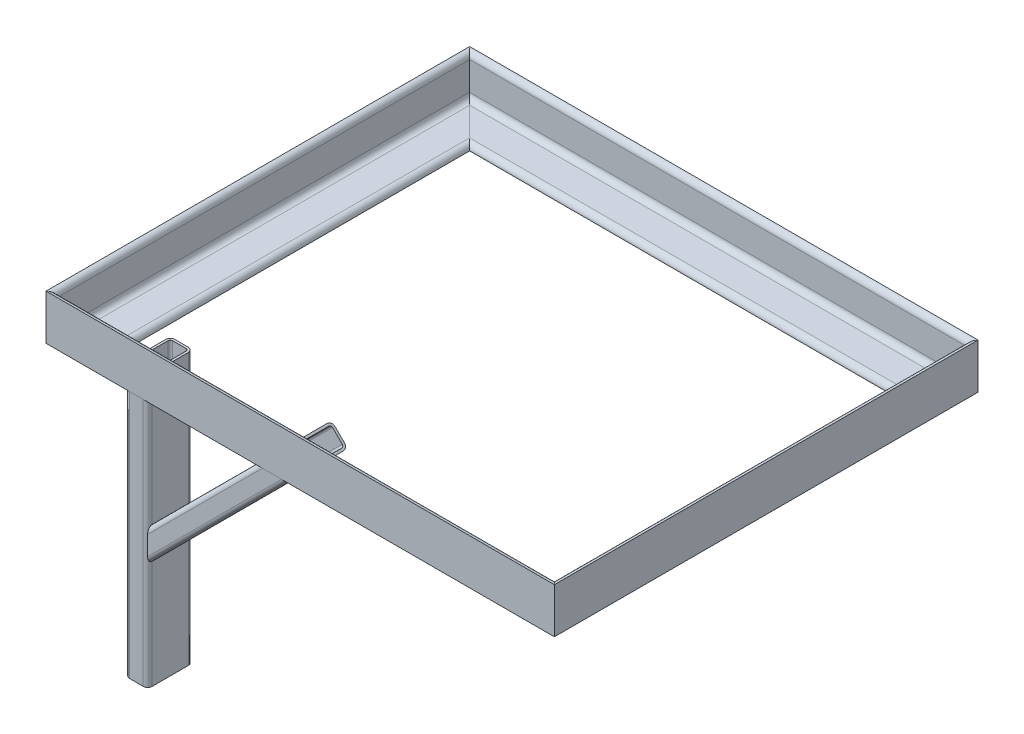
ISO-10303-21;
HEADER;
FILE_DESCRIPTION(('STEP AP214'),'2;1');
FILE_NAME('part.step','',(''),(''),'','','');
FILE_SCHEMA(('AUTOMOTIVE_DESIGN { 1 0 10303 214 1 1 1 1 }'));
ENDSEC;
DATA;
#1=APPLICATION_CONTEXT('core data for automotive mechanical design processes');
#2=APPLICATION_PROTOCOL_DEFINITION('international standard','automotive_design',2000,#1);
#3=PRODUCT_CONTEXT('',#1,'mechanical');
#4=PRODUCT('Part','Part','',(#3));
#5=PRODUCT_RELATED_PRODUCT_CATEGORY('part','',(#4));
#6=PRODUCT_DEFINITION_FORMATION('','',#4);
#7=PRODUCT_DEFINITION_CONTEXT('part definition',#1,'design');
#8=PRODUCT_DEFINITION('design','',#6,#7);
#9=PRODUCT_DEFINITION_SHAPE('','',#8);
#10=(LENGTH_UNIT() NAMED_UNIT(*) SI_UNIT(.MILLI.,.METRE.));
#11=(NAMED_UNIT(*) PLANE_ANGLE_UNIT() SI_UNIT($,.RADIAN.));
#12=(NAMED_UNIT(*) SI_UNIT($,.STERADIAN.) SOLID_ANGLE_UNIT());
#13=UNCERTAINTY_MEASURE_WITH_UNIT(LENGTH_MEASURE(1.E-05),#10,'distance_accuracy_value','');
#14=(GEOMETRIC_REPRESENTATION_CONTEXT(3) GLOBAL_UNCERTAINTY_ASSIGNED_CONTEXT((#13)) GLOBAL_UNIT_ASSIGNED_CONTEXT((#10,
#11,#12)) REPRESENTATION_CONTEXT('',''));
#15=CARTESIAN_POINT('',(0.,0.,0.));
#16=DIRECTION('',(0.,0.,1.));
#17=DIRECTION('',(1.,0.,0.));
#18=AXIS2_PLACEMENT_3D('',#15,#16,#17);
#19=CARTESIAN_POINT('',(1.31370849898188,488.686291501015,303.));
#20=DIRECTION('',(-0.707106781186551,0.707106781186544,0.));
#21=DIRECTION('',(-0.707106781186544,-0.707106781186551,0.));
#22=AXIS2_PLACEMENT_3D('',#19,#20,#21);
#23=PLANE('',#22);
#24=DIRECTION('',(-0.707106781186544,-0.707106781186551,0.));
#25=VECTOR('',#24,1.);
#26=CARTESIAN_POINT('',(1.31370849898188,488.686291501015,303.));
#27=LINE('',#26,#25);
#28=CARTESIAN_POINT('',(1.31370849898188,488.686291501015,303.));
#29=VERTEX_POINT('',#28);
#30=CARTESIAN_POINT('',(-270.,217.372583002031,303.));
#31=VERTEX_POINT('',#30);
#32=EDGE_CURVE('E243',#29,#31,#27,.T.);
#33=ORIENTED_EDGE('',*,*,#32,.T.);
#34=DIRECTION('',(0.,0.,1.));
#35=VECTOR('',#34,1.);
#36=CARTESIAN_POINT('',(-270.,217.372583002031,303.));
#37=LINE('',#36,#35);
#38=CARTESIAN_POINT('',(-270.,217.37258300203,367.));
#39=VERTEX_POINT('',#38);
#40=EDGE_CURVE('E229',#31,#39,#37,.T.);
#41=ORIENTED_EDGE('',*,*,#40,.T.);
#42=DIRECTION('',(-0.707106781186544,-0.707106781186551,0.));
#43=VECTOR('',#42,1.);
#44=CARTESIAN_POINT('',(1.31370849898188,488.686291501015,367.));
#45=LINE('',#44,#43);
#46=CARTESIAN_POINT('',(1.31370849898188,488.686291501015,367.));
#47=VERTEX_POINT('',#46);
#48=EDGE_CURVE('E240',#47,#39,#45,.T.);
#49=ORIENTED_EDGE('',*,*,#48,.F.);
#50=DIRECTION('',(0.,0.,-1.));
#51=VECTOR('',#50,1.);
#52=CARTESIAN_POINT('',(1.31370849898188,488.686291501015,303.));
#53=LINE('',#52,#51);
#54=EDGE_CURVE('E319',#47,#29,#53,.T.);
#55=ORIENTED_EDGE('',*,*,#54,.T.);
#56=EDGE_LOOP('',(#33,#41,#49,#55));
#57=FACE_BOUND('',#56,.T.);
#58=ADVANCED_FACE('F101',(#57),#23,.T.);
#59=CARTESIAN_POINT('',(-1.51471862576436,491.514718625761,303.));
#60=DIRECTION('',(-0.707106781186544,-0.707106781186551,0.));
#61=DIRECTION('',(0.707106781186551,-0.707106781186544,0.));
#62=AXIS2_PLACEMENT_3D('',#59,#60,#61);
#63=CYLINDRICAL_SURFACE('',#62,4.);
#64=DIRECTION('',(-0.707106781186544,-0.707106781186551,0.));
#65=VECTOR('',#64,1.);
#66=CARTESIAN_POINT('',(-1.51471862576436,491.514718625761,299.));
#67=LINE('',#66,#65);
#68=CARTESIAN_POINT('',(-1.51471862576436,491.514718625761,299.));
#69=VERTEX_POINT('',#68);
#70=CARTESIAN_POINT('',(-270.,223.029437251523,299.));
#71=VERTEX_POINT('',#70);
#72=EDGE_CURVE('E247',#69,#71,#67,.T.);
#73=ORIENTED_EDGE('',*,*,#72,.T.);
#74=CARTESIAN_POINT('',(-270.,223.029437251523,303.));
#75=DIRECTION('',(-1.,0.,0.));
#76=DIRECTION('',(0.,-1.,0.));
#77=AXIS2_PLACEMENT_3D('',#74,#75,#76);
#78=ELLIPSE('',#77,5.65685424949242,4.);
#79=EDGE_CURVE('E347',#71,#31,#78,.T.);
#80=ORIENTED_EDGE('',*,*,#79,.T.);
#81=ORIENTED_EDGE('',*,*,#32,.F.);
#82=CARTESIAN_POINT('',(-1.51471862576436,491.514718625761,303.));
#83=DIRECTION('',(0.707106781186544,0.707106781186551,0.));
#84=DIRECTION('',(0.,0.,1.));
#85=AXIS2_PLACEMENT_3D('',#82,#83,#84);
#86=CIRCLE('',#85,4.);
#87=EDGE_CURVE('E316',#29,#69,#86,.T.);
#88=ORIENTED_EDGE('',*,*,#87,.T.);
#89=EDGE_LOOP('',(#73,#80,#81,#88));
#90=FACE_BOUND('',#89,.T.);
#91=ADVANCED_FACE('F381',(#90),#63,.F.);
#92=CARTESIAN_POINT('',(-1.51471862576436,491.514718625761,299.));
#93=DIRECTION('',(0.,0.,1.));
#94=DIRECTION('',(1.,0.,0.));
#95=AXIS2_PLACEMENT_3D('',#92,#93,#94);
#96=PLANE('',#95);
#97=DIRECTION('',(-0.707106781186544,-0.707106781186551,0.));
#98=VECTOR('',#97,1.);
#99=CARTESIAN_POINT('',(-18.4852813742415,508.485281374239,299.));
#100=LINE('',#99,#98);
#101=CARTESIAN_POINT('',(-18.4852813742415,508.485281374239,299.));
#102=VERTEX_POINT('',#101);
#103=CARTESIAN_POINT('',(-270.,256.970562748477,299.));
#104=VERTEX_POINT('',#103);
#105=EDGE_CURVE('E250',#102,#104,#100,.T.);
#106=ORIENTED_EDGE('',*,*,#105,.T.);
#107=DIRECTION('',(0.,-1.,0.));
#108=VECTOR('',#107,1.);
#109=CARTESIAN_POINT('',(-270.,491.514718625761,299.));
#110=LINE('',#109,#108);
#111=EDGE_CURVE('E350',#104,#71,#110,.T.);
#112=ORIENTED_EDGE('',*,*,#111,.T.);
#113=ORIENTED_EDGE('',*,*,#72,.F.);
#114=DIRECTION('',(-0.707106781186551,0.707106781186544,0.));
#115=VECTOR('',#114,1.);
#116=CARTESIAN_POINT('',(-1.51471862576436,491.514718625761,299.));
#117=LINE('',#116,#115);
#118=EDGE_CURVE('E313',#69,#102,#117,.T.);
#119=ORIENTED_EDGE('',*,*,#118,.T.);
#120=EDGE_LOOP('',(#106,#112,#113,#119));
#121=FACE_BOUND('',#120,.T.);
#122=ADVANCED_FACE('F387',(#121),#96,.T.);
#123=CARTESIAN_POINT('',(-18.4852813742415,508.485281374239,303.));
#124=DIRECTION('',(-0.707106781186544,-0.707106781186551,0.));
#125=DIRECTION('',(0.707106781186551,-0.707106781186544,0.));
#126=AXIS2_PLACEMENT_3D('',#123,#124,#125);
#127=CYLINDRICAL_SURFACE('',#126,4.);
#128=DIRECTION('',(-0.707106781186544,-0.707106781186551,0.));
#129=VECTOR('',#128,1.);
#130=CARTESIAN_POINT('',(-21.3137084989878,511.313708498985,303.));
#131=LINE('',#130,#129);
#132=CARTESIAN_POINT('',(-21.3137084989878,511.313708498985,303.));
#133=VERTEX_POINT('',#132);
#134=CARTESIAN_POINT('',(-270.,262.62741699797,303.));
#135=VERTEX_POINT('',#134);
#136=EDGE_CURVE('E253',#133,#135,#131,.T.);
#137=ORIENTED_EDGE('',*,*,#136,.T.);
#138=CARTESIAN_POINT('',(-270.,256.970562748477,303.));
#139=DIRECTION('',(-1.,0.,0.));
#140=DIRECTION('',(0.,-1.,0.));
#141=AXIS2_PLACEMENT_3D('',#138,#139,#140);
#142=ELLIPSE('',#141,5.65685424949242,4.);
#143=EDGE_CURVE('E353',#135,#104,#142,.T.);
#144=ORIENTED_EDGE('',*,*,#143,.T.);
#145=ORIENTED_EDGE('',*,*,#105,.F.);
#146=CARTESIAN_POINT('',(-18.4852813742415,508.485281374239,303.));
#147=DIRECTION('',(0.707106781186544,0.707106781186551,0.));
#148=DIRECTION('',(0.,0.,1.));
#149=AXIS2_PLACEMENT_3D('',#146,#147,#148);
#150=CIRCLE('',#149,4.);
#151=EDGE_CURVE('E310',#102,#133,#150,.T.);
#152=ORIENTED_EDGE('',*,*,#151,.T.);
#153=EDGE_LOOP('',(#137,#144,#145,#152));
#154=FACE_BOUND('',#153,.T.);
#155=ADVANCED_FACE('F395',(#154),#127,.F.);
#156=CARTESIAN_POINT('',(-21.3137084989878,511.313708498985,367.));
#157=DIRECTION('',(0.707106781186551,-0.707106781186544,0.));
#158=DIRECTION('',(0.707106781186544,0.707106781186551,0.));
#159=AXIS2_PLACEMENT_3D('',#156,#157,#158);
#160=PLANE('',#159);
#161=DIRECTION('',(-0.707106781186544,-0.707106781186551,0.));
#162=VECTOR('',#161,1.);
#163=CARTESIAN_POINT('',(-21.3137084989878,511.313708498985,367.));
#164=LINE('',#163,#162);
#165=CARTESIAN_POINT('',(-21.3137084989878,511.313708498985,367.));
#166=VERTEX_POINT('',#165);
#167=CARTESIAN_POINT('',(-270.,262.62741699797,367.));
#168=VERTEX_POINT('',#167);
#169=EDGE_CURVE('E256',#166,#168,#164,.T.);
#170=ORIENTED_EDGE('',*,*,#169,.T.);
#171=DIRECTION('',(0.,0.,-1.));
#172=VECTOR('',#171,1.);
#173=CARTESIAN_POINT('',(-270.,262.62741699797,367.));
#174=LINE('',#173,#172);
#175=EDGE_CURVE('E356',#168,#135,#174,.T.);
#176=ORIENTED_EDGE('',*,*,#175,.T.);
#177=ORIENTED_EDGE('',*,*,#136,.F.);
#178=DIRECTION('',(0.,0.,1.));
#179=VECTOR('',#178,1.);
#180=CARTESIAN_POINT('',(-21.3137084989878,511.313708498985,367.));
#181=LINE('',#180,#179);
#182=EDGE_CURVE('E307',#133,#166,#181,.T.);
#183=ORIENTED_EDGE('',*,*,#182,.T.);
#184=EDGE_LOOP('',(#170,#176,#177,#183));
#185=FACE_BOUND('',#184,.T.);
#186=ADVANCED_FACE('F399',(#185),#160,.T.);
#187=CARTESIAN_POINT('',(-18.4852813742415,508.485281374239,367.));
#188=DIRECTION('',(-0.707106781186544,-0.707106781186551,0.));
#189=DIRECTION('',(0.707106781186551,-0.707106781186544,0.));
#190=AXIS2_PLACEMENT_3D('',#187,#188,#189);
#191=CYLINDRICAL_SURFACE('',#190,4.);
#192=DIRECTION('',(-0.707106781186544,-0.707106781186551,0.));
#193=VECTOR('',#192,1.);
#194=CARTESIAN_POINT('',(-18.4852813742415,508.485281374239,371.));
#195=LINE('',#194,#193);
#196=CARTESIAN_POINT('',(-18.4852813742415,508.485281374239,371.));
#197=VERTEX_POINT('',#196);
#198=CARTESIAN_POINT('',(-270.,256.970562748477,371.));
#199=VERTEX_POINT('',#198);
#200=EDGE_CURVE('E259',#197,#199,#195,.T.);
#201=ORIENTED_EDGE('',*,*,#200,.T.);
#202=CARTESIAN_POINT('',(-270.,256.970562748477,367.));
#203=DIRECTION('',(-1.,0.,0.));
#204=DIRECTION('',(0.,-1.,0.));
#205=AXIS2_PLACEMENT_3D('',#202,#203,#204);
#206=ELLIPSE('',#205,5.65685424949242,4.);
#207=EDGE_CURVE('E359',#199,#168,#206,.T.);
#208=ORIENTED_EDGE('',*,*,#207,.T.);
#209=ORIENTED_EDGE('',*,*,#169,.F.);
#210=CARTESIAN_POINT('',(-18.4852813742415,508.485281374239,367.));
#211=DIRECTION('',(0.707106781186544,0.707106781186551,0.));
#212=DIRECTION('',(0.,0.,1.));
#213=AXIS2_PLACEMENT_3D('',#210,#211,#212);
#214=CIRCLE('',#213,4.);
#215=EDGE_CURVE('E304',#166,#197,#214,.T.);
#216=ORIENTED_EDGE('',*,*,#215,.T.);
#217=EDGE_LOOP('',(#201,#208,#209,#216));
#218=FACE_BOUND('',#217,.T.);
#219=ADVANCED_FACE('F403',(#218),#191,.F.);
#220=CARTESIAN_POINT('',(-18.4852813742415,508.485281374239,371.));
#221=DIRECTION('',(0.,0.,-1.));
#222=DIRECTION('',(-1.,0.,0.));
#223=AXIS2_PLACEMENT_3D('',#220,#221,#222);
#224=PLANE('',#223);
#225=DIRECTION('',(-0.707106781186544,-0.707106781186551,0.));
#226=VECTOR('',#225,1.);
#227=CARTESIAN_POINT('',(-1.51471862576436,491.514718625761,371.));
#228=LINE('',#227,#226);
#229=CARTESIAN_POINT('',(-1.51471862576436,491.514718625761,371.));
#230=VERTEX_POINT('',#229);
#231=CARTESIAN_POINT('',(-270.,223.029437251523,371.));
#232=VERTEX_POINT('',#231);
#233=EDGE_CURVE('E261',#230,#232,#228,.T.);
#234=ORIENTED_EDGE('',*,*,#233,.T.);
#235=DIRECTION('',(0.,1.,0.));
#236=VECTOR('',#235,1.);
#237=CARTESIAN_POINT('',(-270.,508.485281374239,371.));
#238=LINE('',#237,#236);
#239=EDGE_CURVE('E362',#232,#199,#238,.T.);
#240=ORIENTED_EDGE('',*,*,#239,.T.);
#241=ORIENTED_EDGE('',*,*,#200,.F.);
#242=DIRECTION('',(0.707106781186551,-0.707106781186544,0.));
#243=VECTOR('',#242,1.);
#244=CARTESIAN_POINT('',(-18.4852813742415,508.485281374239,371.));
#245=LINE('',#244,#243);
#246=EDGE_CURVE('E297',#197,#230,#245,.T.);
#247=ORIENTED_EDGE('',*,*,#246,.T.);
#248=EDGE_LOOP('',(#234,#240,#241,#247));
#249=FACE_BOUND('',#248,.T.);
#250=ADVANCED_FACE('F406',(#249),#224,.T.);
#251=CARTESIAN_POINT('',(-1.51471862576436,491.514718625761,367.));
#252=DIRECTION('',(-0.707106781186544,-0.707106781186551,0.));
#253=DIRECTION('',(0.707106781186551,-0.707106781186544,0.));
#254=AXIS2_PLACEMENT_3D('',#251,#252,#253);
#255=CYLINDRICAL_SURFACE('',#254,4.);
#256=ORIENTED_EDGE('',*,*,#48,.T.);
#257=CARTESIAN_POINT('',(-270.,223.029437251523,367.));
#258=DIRECTION('',(-1.,0.,0.));
#259=DIRECTION('',(0.,-1.,0.));
#260=AXIS2_PLACEMENT_3D('',#257,#258,#259);
#261=ELLIPSE('',#260,5.65685424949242,4.);
#262=EDGE_CURVE('E116',#39,#232,#261,.T.);
#263=ORIENTED_EDGE('',*,*,#262,.T.);
#264=ORIENTED_EDGE('',*,*,#233,.F.);
#265=CARTESIAN_POINT('',(-1.51471862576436,491.514718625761,367.));
#266=DIRECTION('',(0.707106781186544,0.707106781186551,0.));
#267=DIRECTION('',(0.,0.,1.));
#268=AXIS2_PLACEMENT_3D('',#265,#266,#267);
#269=CIRCLE('',#268,4.);
#270=EDGE_CURVE('E294',#230,#47,#269,.T.);
#271=ORIENTED_EDGE('',*,*,#270,.T.);
#272=EDGE_LOOP('',(#256,#263,#264,#271));
#273=FACE_BOUND('',#272,.T.);
#274=ADVANCED_FACE('F103',(#273),#255,.F.);
#275=CARTESIAN_POINT('',(-18.4852813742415,508.485281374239,367.));
#276=DIRECTION('',(0.707106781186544,0.707106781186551,0.));
#277=DIRECTION('',(0.,0.,1.));
#278=AXIS2_PLACEMENT_3D('',#275,#276,#277);
#279=PLANE('',#278);
#280=ORIENTED_EDGE('',*,*,#270,.F.);
#281=ORIENTED_EDGE('',*,*,#246,.F.);
#282=ORIENTED_EDGE('',*,*,#215,.F.);
#283=ORIENTED_EDGE('',*,*,#182,.F.);
#284=ORIENTED_EDGE('',*,*,#151,.F.);
#285=ORIENTED_EDGE('',*,*,#118,.F.);
#286=ORIENTED_EDGE('',*,*,#87,.F.);
#287=ORIENTED_EDGE('',*,*,#54,.F.);
#288=EDGE_LOOP('',(#280,#281,#282,#283,#284,#285,#286,#287));
#289=FACE_BOUND('',#288,.T.);
#290=CARTESIAN_POINT('',(-18.4852813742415,508.485281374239,367.));
#291=DIRECTION('',(0.707106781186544,0.707106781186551,0.));
#292=DIRECTION('',(0.,0.,1.));
#293=AXIS2_PLACEMENT_3D('',#290,#291,#292);
#294=CIRCLE('',#293,8.00000000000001);
#295=CARTESIAN_POINT('',(-24.142135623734,514.142135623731,367.));
#296=VERTEX_POINT('',#295);
#297=CARTESIAN_POINT('',(-18.4852813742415,508.485281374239,375.));
#298=VERTEX_POINT('',#297);
#299=EDGE_CURVE('E322',#296,#298,#294,.T.);
#300=ORIENTED_EDGE('',*,*,#299,.T.);
#301=DIRECTION('',(0.707106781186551,-0.707106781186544,0.));
#302=VECTOR('',#301,1.);
#303=CARTESIAN_POINT('',(-18.4852813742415,508.485281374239,375.));
#304=LINE('',#303,#302);
#305=CARTESIAN_POINT('',(-1.51471862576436,491.514718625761,375.));
#306=VERTEX_POINT('',#305);
#307=EDGE_CURVE('E232',#298,#306,#304,.T.);
#308=ORIENTED_EDGE('',*,*,#307,.T.);
#309=CARTESIAN_POINT('',(-1.51471862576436,491.514718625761,367.));
#310=DIRECTION('',(0.707106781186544,0.707106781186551,0.));
#311=DIRECTION('',(0.,0.,1.));
#312=AXIS2_PLACEMENT_3D('',#309,#310,#311);
#313=CIRCLE('',#312,8.00000000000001);
#314=CARTESIAN_POINT('',(4.14213562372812,485.857864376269,367.));
#315=VERTEX_POINT('',#314);
#316=EDGE_CURVE('E293',#306,#315,#313,.T.);
#317=ORIENTED_EDGE('',*,*,#316,.T.);
#318=DIRECTION('',(0.,0.,-1.));
#319=VECTOR('',#318,1.);
#320=CARTESIAN_POINT('',(4.14213562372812,485.857864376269,303.));
#321=LINE('',#320,#319);
#322=CARTESIAN_POINT('',(4.14213562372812,485.857864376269,303.));
#323=VERTEX_POINT('',#322);
#324=EDGE_CURVE('E289',#315,#323,#321,.T.);
#325=ORIENTED_EDGE('',*,*,#324,.T.);
#326=CARTESIAN_POINT('',(-1.51471862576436,491.514718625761,303.));
#327=DIRECTION('',(0.707106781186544,0.707106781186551,0.));
#328=DIRECTION('',(0.,0.,1.));
#329=AXIS2_PLACEMENT_3D('',#326,#327,#328);
#330=CIRCLE('',#329,8.00000000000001);
#331=CARTESIAN_POINT('',(-1.51471862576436,491.514718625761,295.));
#332=VERTEX_POINT('',#331);
#333=EDGE_CURVE('E327',#323,#332,#330,.T.);
#334=ORIENTED_EDGE('',*,*,#333,.T.);
#335=DIRECTION('',(-0.707106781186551,0.707106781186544,0.));
#336=VECTOR('',#335,1.);
#337=CARTESIAN_POINT('',(-1.51471862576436,491.514718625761,295.));
#338=LINE('',#337,#336);
#339=CARTESIAN_POINT('',(-18.4852813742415,508.485281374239,295.));
#340=VERTEX_POINT('',#339);
#341=EDGE_CURVE('E329',#332,#340,#338,.T.);
#342=ORIENTED_EDGE('',*,*,#341,.T.);
#343=CARTESIAN_POINT('',(-18.4852813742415,508.485281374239,303.));
#344=DIRECTION('',(0.707106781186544,0.707106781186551,0.));
#345=DIRECTION('',(0.,0.,1.));
#346=AXIS2_PLACEMENT_3D('',#343,#344,#345);
#347=CIRCLE('',#346,8.00000000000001);
#348=CARTESIAN_POINT('',(-24.142135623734,514.142135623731,303.));
#349=VERTEX_POINT('',#348);
#350=EDGE_CURVE('E330',#340,#349,#347,.T.);
#351=ORIENTED_EDGE('',*,*,#350,.T.);
#352=DIRECTION('',(0.,0.,1.));
#353=VECTOR('',#352,1.);
#354=CARTESIAN_POINT('',(-24.142135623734,514.142135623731,367.));
#355=LINE('',#354,#353);
#356=EDGE_CURVE('E244',#349,#296,#355,.T.);
#357=ORIENTED_EDGE('',*,*,#356,.T.);
#358=EDGE_LOOP('',(#300,#308,#317,#325,#334,#342,#351,#357));
#359=FACE_BOUND('',#358,.T.);
#360=ADVANCED_FACE('F335',(#289,#359),#279,.T.);
#361=CARTESIAN_POINT('',(-24.142135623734,514.142135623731,367.));
#362=DIRECTION('',(0.707106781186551,-0.707106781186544,0.));
#363=DIRECTION('',(0.707106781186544,0.707106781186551,0.));
#364=AXIS2_PLACEMENT_3D('',#361,#362,#363);
#365=PLANE('',#364);
#366=DIRECTION('',(0.,0.,-1.));
#367=VECTOR('',#366,1.);
#368=CARTESIAN_POINT('',(-270.,268.284271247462,367.));
#369=LINE('',#368,#367);
#370=CARTESIAN_POINT('',(-270.,268.284271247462,367.));
#371=VERTEX_POINT('',#370);
#372=CARTESIAN_POINT('',(-270.,268.284271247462,303.));
#373=VERTEX_POINT('',#372);
#374=EDGE_CURVE('E14',#371,#373,#369,.T.);
#375=ORIENTED_EDGE('',*,*,#374,.F.);
#376=DIRECTION('',(-0.707106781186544,-0.707106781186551,0.));
#377=VECTOR('',#376,1.);
#378=CARTESIAN_POINT('',(-24.142135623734,514.142135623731,367.));
#379=LINE('',#378,#377);
#380=EDGE_CURVE('E228',#296,#371,#379,.T.);
#381=ORIENTED_EDGE('',*,*,#380,.F.);
#382=ORIENTED_EDGE('',*,*,#356,.F.);
#383=DIRECTION('',(-0.707106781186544,-0.707106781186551,0.));
#384=VECTOR('',#383,1.);
#385=CARTESIAN_POINT('',(-24.142135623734,514.142135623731,303.));
#386=LINE('',#385,#384);
#387=EDGE_CURVE('E266',#349,#373,#386,.T.);
#388=ORIENTED_EDGE('',*,*,#387,.T.);
#389=EDGE_LOOP('',(#375,#381,#382,#388));
#390=FACE_BOUND('',#389,.T.);
#391=ADVANCED_FACE('F337',(#390),#365,.F.);
#392=CARTESIAN_POINT('',(-18.4852813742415,508.485281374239,303.));
#393=DIRECTION('',(-0.707106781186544,-0.707106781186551,0.));
#394=DIRECTION('',(0.707106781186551,-0.707106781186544,0.));
#395=AXIS2_PLACEMENT_3D('',#392,#393,#394);
#396=CYLINDRICAL_SURFACE('',#395,8.00000000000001);
#397=CARTESIAN_POINT('',(-270.,256.970562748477,303.));
#398=DIRECTION('',(-1.,0.,0.));
#399=DIRECTION('',(0.,-1.,0.));
#400=AXIS2_PLACEMENT_3D('',#397,#398,#399);
#401=ELLIPSE('',#400,11.3137084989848,8.00000000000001);
#402=CARTESIAN_POINT('',(-270.,256.970562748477,295.));
#403=VERTEX_POINT('',#402);
#404=EDGE_CURVE('E219',#373,#403,#401,.T.);
#405=ORIENTED_EDGE('',*,*,#404,.F.);
#406=ORIENTED_EDGE('',*,*,#387,.F.);
#407=ORIENTED_EDGE('',*,*,#350,.F.);
#408=DIRECTION('',(-0.707106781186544,-0.707106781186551,0.));
#409=VECTOR('',#408,1.);
#410=CARTESIAN_POINT('',(-18.4852813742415,508.485281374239,295.));
#411=LINE('',#410,#409);
#412=EDGE_CURVE('E269',#340,#403,#411,.T.);
#413=ORIENTED_EDGE('',*,*,#412,.T.);
#414=EDGE_LOOP('',(#405,#406,#407,#413));
#415=FACE_BOUND('',#414,.T.);
#416=ADVANCED_FACE('F341',(#415),#396,.T.);
#417=CARTESIAN_POINT('',(-1.51471862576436,491.514718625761,295.));
#418=DIRECTION('',(0.,0.,1.));
#419=DIRECTION('',(1.,0.,0.));
#420=AXIS2_PLACEMENT_3D('',#417,#418,#419);
#421=PLANE('',#420);
#422=DIRECTION('',(0.,-1.,0.));
#423=VECTOR('',#422,1.);
#424=CARTESIAN_POINT('',(-270.,500.,295.));
#425=LINE('',#424,#423);
#426=CARTESIAN_POINT('',(-270.,223.029437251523,295.));
#427=VERTEX_POINT('',#426);
#428=EDGE_CURVE('E220',#403,#427,#425,.T.);
#429=ORIENTED_EDGE('',*,*,#428,.F.);
#430=ORIENTED_EDGE('',*,*,#412,.F.);
#431=ORIENTED_EDGE('',*,*,#341,.F.);
#432=DIRECTION('',(-0.707106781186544,-0.707106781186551,0.));
#433=VECTOR('',#432,1.);
#434=CARTESIAN_POINT('',(-1.51471862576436,491.514718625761,295.));
#435=LINE('',#434,#433);
#436=EDGE_CURVE('E276',#332,#427,#435,.T.);
#437=ORIENTED_EDGE('',*,*,#436,.T.);
#438=EDGE_LOOP('',(#429,#430,#431,#437));
#439=FACE_BOUND('',#438,.T.);
#440=ADVANCED_FACE('F371',(#439),#421,.F.);
#441=CARTESIAN_POINT('',(-1.51471862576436,491.514718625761,303.));
#442=DIRECTION('',(-0.707106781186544,-0.707106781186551,0.));
#443=DIRECTION('',(0.707106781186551,-0.707106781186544,0.));
#444=AXIS2_PLACEMENT_3D('',#441,#442,#443);
#445=CYLINDRICAL_SURFACE('',#444,8.00000000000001);
#446=CARTESIAN_POINT('',(-270.,223.029437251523,303.));
#447=DIRECTION('',(-1.,0.,0.));
#448=DIRECTION('',(0.,-1.,0.));
#449=AXIS2_PLACEMENT_3D('',#446,#447,#448);
#450=ELLIPSE('',#449,11.3137084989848,8.00000000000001);
#451=CARTESIAN_POINT('',(-270.,211.715728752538,303.));
#452=VERTEX_POINT('',#451);
#453=EDGE_CURVE('E299',#427,#452,#450,.T.);
#454=ORIENTED_EDGE('',*,*,#453,.F.);
#455=ORIENTED_EDGE('',*,*,#436,.F.);
#456=ORIENTED_EDGE('',*,*,#333,.F.);
#457=DIRECTION('',(-0.707106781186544,-0.707106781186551,0.));
#458=VECTOR('',#457,1.);
#459=CARTESIAN_POINT('',(4.14213562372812,485.857864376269,303.));
#460=LINE('',#459,#458);
#461=EDGE_CURVE('E279',#323,#452,#460,.T.);
#462=ORIENTED_EDGE('',*,*,#461,.T.);
#463=EDGE_LOOP('',(#454,#455,#456,#462));
#464=FACE_BOUND('',#463,.T.);
#465=ADVANCED_FACE('F367',(#464),#445,.T.);
#466=CARTESIAN_POINT('',(4.14213562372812,485.857864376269,303.));
#467=DIRECTION('',(-0.707106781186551,0.707106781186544,0.));
#468=DIRECTION('',(-0.707106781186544,-0.707106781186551,0.));
#469=AXIS2_PLACEMENT_3D('',#466,#467,#468);
#470=PLANE('',#469);
#471=DIRECTION('',(0.,0.,1.));
#472=VECTOR('',#471,1.);
#473=CARTESIAN_POINT('',(-270.,211.715728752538,303.));
#474=LINE('',#473,#472);
#475=CARTESIAN_POINT('',(-270.,211.715728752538,367.));
#476=VERTEX_POINT('',#475);
#477=EDGE_CURVE('E288',#452,#476,#474,.T.);
#478=ORIENTED_EDGE('',*,*,#477,.F.);
#479=ORIENTED_EDGE('',*,*,#461,.F.);
#480=ORIENTED_EDGE('',*,*,#324,.F.);
#481=DIRECTION('',(-0.707106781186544,-0.707106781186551,0.));
#482=VECTOR('',#481,1.);
#483=CARTESIAN_POINT('',(4.14213562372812,485.857864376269,367.));
#484=LINE('',#483,#482);
#485=EDGE_CURVE('E236',#315,#476,#484,.T.);
#486=ORIENTED_EDGE('',*,*,#485,.T.);
#487=EDGE_LOOP('',(#478,#479,#480,#486));
#488=FACE_BOUND('',#487,.T.);
#489=ADVANCED_FACE('F286',(#488),#470,.F.);
#490=CARTESIAN_POINT('',(-1.51471862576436,491.514718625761,367.));
#491=DIRECTION('',(-0.707106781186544,-0.707106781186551,0.));
#492=DIRECTION('',(0.707106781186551,-0.707106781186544,0.));
#493=AXIS2_PLACEMENT_3D('',#490,#491,#492);
#494=CYLINDRICAL_SURFACE('',#493,8.00000000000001);
#495=CARTESIAN_POINT('',(-270.,223.029437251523,367.));
#496=DIRECTION('',(-1.,0.,0.));
#497=DIRECTION('',(0.,-1.,0.));
#498=AXIS2_PLACEMENT_3D('',#495,#496,#497);
#499=ELLIPSE('',#498,11.3137084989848,8.00000000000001);
#500=CARTESIAN_POINT('',(-270.,223.029437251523,375.));
#501=VERTEX_POINT('',#500);
#502=EDGE_CURVE('E214',#476,#501,#499,.T.);
#503=ORIENTED_EDGE('',*,*,#502,.F.);
#504=ORIENTED_EDGE('',*,*,#485,.F.);
#505=ORIENTED_EDGE('',*,*,#316,.F.);
#506=DIRECTION('',(-0.707106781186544,-0.707106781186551,0.));
#507=VECTOR('',#506,1.);
#508=CARTESIAN_POINT('',(-1.51471862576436,491.514718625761,375.));
#509=LINE('',#508,#507);
#510=EDGE_CURVE('E234',#306,#501,#509,.T.);
#511=ORIENTED_EDGE('',*,*,#510,.T.);
#512=EDGE_LOOP('',(#503,#504,#505,#511));
#513=FACE_BOUND('',#512,.T.);
#514=ADVANCED_FACE('F292',(#513),#494,.T.);
#515=CARTESIAN_POINT('',(-18.4852813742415,508.485281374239,375.));
#516=DIRECTION('',(0.,0.,-1.));
#517=DIRECTION('',(-1.,0.,0.));
#518=AXIS2_PLACEMENT_3D('',#515,#516,#517);
#519=PLANE('',#518);
#520=DIRECTION('',(0.,-1.,0.));
#521=VECTOR('',#520,1.);
#522=CARTESIAN_POINT('',(-270.,500.,375.));
#523=LINE('',#522,#521);
#524=CARTESIAN_POINT('',(-270.,256.970562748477,375.));
#525=VERTEX_POINT('',#524);
#526=EDGE_CURVE('E211',#525,#501,#523,.T.);
#527=ORIENTED_EDGE('',*,*,#526,.T.);
#528=ORIENTED_EDGE('',*,*,#510,.F.);
#529=ORIENTED_EDGE('',*,*,#307,.F.);
#530=DIRECTION('',(-0.707106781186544,-0.707106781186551,0.));
#531=VECTOR('',#530,1.);
#532=CARTESIAN_POINT('',(-18.4852813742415,508.485281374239,375.));
#533=LINE('',#532,#531);
#534=EDGE_CURVE('E109',#298,#525,#533,.T.);
#535=ORIENTED_EDGE('',*,*,#534,.T.);
#536=EDGE_LOOP('',(#527,#528,#529,#535));
#537=FACE_BOUND('',#536,.T.);
#538=ADVANCED_FACE('F231',(#537),#519,.F.);
#539=CARTESIAN_POINT('',(-18.4852813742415,508.485281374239,367.));
#540=DIRECTION('',(-0.707106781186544,-0.707106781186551,0.));
#541=DIRECTION('',(0.707106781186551,-0.707106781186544,0.));
#542=AXIS2_PLACEMENT_3D('',#539,#540,#541);
#543=CYLINDRICAL_SURFACE('',#542,8.00000000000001);
#544=CARTESIAN_POINT('',(-270.,256.970562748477,367.));
#545=DIRECTION('',(-1.,0.,0.));
#546=DIRECTION('',(0.,-1.,0.));
#547=AXIS2_PLACEMENT_3D('',#544,#545,#546);
#548=ELLIPSE('',#547,11.3137084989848,8.00000000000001);
#549=EDGE_CURVE('E123',#525,#371,#548,.T.);
#550=ORIENTED_EDGE('',*,*,#549,.F.);
#551=ORIENTED_EDGE('',*,*,#534,.F.);
#552=ORIENTED_EDGE('',*,*,#299,.F.);
#553=ORIENTED_EDGE('',*,*,#380,.T.);
#554=EDGE_LOOP('',(#550,#551,#552,#553));
#555=FACE_BOUND('',#554,.T.);
#556=ADVANCED_FACE('F225',(#555),#543,.T.);
#557=CARTESIAN_POINT('',(-270.,500.,303.));
#558=DIRECTION('',(-1.,0.,0.));
#559=DIRECTION('',(0.,0.,1.));
#560=AXIS2_PLACEMENT_3D('',#557,#558,#559);
#561=PLANE('',#560);
#562=ORIENTED_EDGE('',*,*,#40,.F.);
#563=ORIENTED_EDGE('',*,*,#79,.F.);
#564=ORIENTED_EDGE('',*,*,#111,.F.);
#565=ORIENTED_EDGE('',*,*,#143,.F.);
#566=ORIENTED_EDGE('',*,*,#175,.F.);
#567=ORIENTED_EDGE('',*,*,#207,.F.);
#568=ORIENTED_EDGE('',*,*,#239,.F.);
#569=ORIENTED_EDGE('',*,*,#262,.F.);
#570=EDGE_LOOP('',(#562,#563,#564,#565,#566,#567,#568,#569));
#571=FACE_BOUND('',#570,.T.);
#572=ORIENTED_EDGE('',*,*,#502,.T.);
#573=ORIENTED_EDGE('',*,*,#526,.F.);
#574=ORIENTED_EDGE('',*,*,#549,.T.);
#575=ORIENTED_EDGE('',*,*,#374,.T.);
#576=ORIENTED_EDGE('',*,*,#404,.T.);
#577=ORIENTED_EDGE('',*,*,#428,.T.);
#578=ORIENTED_EDGE('',*,*,#453,.T.);
#579=ORIENTED_EDGE('',*,*,#477,.T.);
#580=EDGE_LOOP('',(#572,#573,#574,#575,#576,#577,#578,#579));
#581=FACE_BOUND('',#580,.T.);
#582=ADVANCED_FACE('F212',(#571,#581),#561,.T.);
#583=CLOSED_SHELL('',(#58,#91,#122,#155,#186,#219,#250,#274,#360,#391,#416,#440,#465,#489,#514,
#538,#556,#582));
#584=MANIFOLD_SOLID_BREP('B2',#583);
#585=CARTESIAN_POINT('',(-302.,500.,367.));
#586=DIRECTION('',(0.,-1.,0.));
#587=DIRECTION('',(0.,0.,-1.));
#588=AXIS2_PLACEMENT_3D('',#585,#586,#587);
#589=CYLINDRICAL_SURFACE('',#588,8.00000000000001);
#590=CARTESIAN_POINT('',(-302.,20.,367.));
#591=DIRECTION('',(0.,1.,0.));
#592=DIRECTION('',(0.,0.,1.));
#593=AXIS2_PLACEMENT_3D('',#590,#591,#592);
#594=CIRCLE('',#593,8.00000000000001);
#595=CARTESIAN_POINT('',(-310.,20.,367.));
#596=VERTEX_POINT('',#595);
#597=CARTESIAN_POINT('',(-302.,20.,375.));
#598=VERTEX_POINT('',#597);
#599=EDGE_CURVE('E810',#596,#598,#594,.T.);
#600=ORIENTED_EDGE('',*,*,#599,.T.);
#601=DIRECTION('',(0.,-1.,0.));
#602=VECTOR('',#601,1.);
#603=CARTESIAN_POINT('',(-302.,500.,375.));
#604=LINE('',#603,#602);
#605=CARTESIAN_POINT('',(-302.,500.,375.));
#606=VERTEX_POINT('',#605);
#607=EDGE_CURVE('E99',#606,#598,#604,.T.);
#608=ORIENTED_EDGE('',*,*,#607,.F.);
#609=CARTESIAN_POINT('',(-302.,500.,367.));
#610=DIRECTION('',(0.,1.,0.));
#611=DIRECTION('',(0.,0.,1.));
#612=AXIS2_PLACEMENT_3D('',#609,#610,#611);
#613=CIRCLE('',#612,8.00000000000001);
#614=CARTESIAN_POINT('',(-310.,500.,367.));
#615=VERTEX_POINT('',#614);
#616=EDGE_CURVE('E888',#615,#606,#613,.T.);
#617=ORIENTED_EDGE('',*,*,#616,.F.);
#618=DIRECTION('',(0.,-1.,0.));
#619=VECTOR('',#618,1.);
#620=CARTESIAN_POINT('',(-310.,500.,367.));
#621=LINE('',#620,#619);
#622=EDGE_CURVE('E825',#615,#596,#621,.T.);
#623=ORIENTED_EDGE('',*,*,#622,.T.);
#624=EDGE_LOOP('',(#600,#608,#617,#623));
#625=FACE_BOUND('',#624,.T.);
#626=ADVANCED_FACE('F638',(#625),#589,.T.);
#627=CARTESIAN_POINT('',(-302.,500.,375.));
#628=DIRECTION('',(0.,0.,-1.));
#629=DIRECTION('',(-1.,0.,0.));
#630=AXIS2_PLACEMENT_3D('',#627,#628,#629);
#631=PLANE('',#630);
#632=DIRECTION('',(1.,0.,0.));
#633=VECTOR('',#632,1.);
#634=CARTESIAN_POINT('',(-302.,20.,375.));
#635=LINE('',#634,#633);
#636=CARTESIAN_POINT('',(-278.,20.,375.));
#637=VERTEX_POINT('',#636);
#638=EDGE_CURVE('E813',#598,#637,#635,.T.);
#639=ORIENTED_EDGE('',*,*,#638,.T.);
#640=DIRECTION('',(0.,-1.,0.));
#641=VECTOR('',#640,1.);
#642=CARTESIAN_POINT('',(-278.,500.,375.));
#643=LINE('',#642,#641);
#644=CARTESIAN_POINT('',(-278.,500.,375.));
#645=VERTEX_POINT('',#644);
#646=EDGE_CURVE('E648',#645,#637,#643,.T.);
#647=ORIENTED_EDGE('',*,*,#646,.F.);
#648=DIRECTION('',(1.,0.,0.));
#649=VECTOR('',#648,1.);
#650=CARTESIAN_POINT('',(-302.,500.,375.));
#651=LINE('',#650,#649);
#652=EDGE_CURVE('E890',#606,#645,#651,.T.);
#653=ORIENTED_EDGE('',*,*,#652,.F.);
#654=ORIENTED_EDGE('',*,*,#607,.T.);
#655=EDGE_LOOP('',(#639,#647,#653,#654));
#656=FACE_BOUND('',#655,.T.);
#657=ADVANCED_FACE('F925',(#656),#631,.F.);
#658=CARTESIAN_POINT('',(-278.,500.,367.));
#659=DIRECTION('',(0.,-1.,0.));
#660=DIRECTION('',(0.,0.,-1.));
#661=AXIS2_PLACEMENT_3D('',#658,#659,#660);
#662=CYLINDRICAL_SURFACE('',#661,8.00000000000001);
#663=CARTESIAN_POINT('',(-278.,20.,367.));
#664=DIRECTION('',(0.,1.,0.));
#665=DIRECTION('',(0.,0.,1.));
#666=AXIS2_PLACEMENT_3D('',#663,#664,#665);
#667=CIRCLE('',#666,8.00000000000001);
#668=CARTESIAN_POINT('',(-270.,20.,367.));
#669=VERTEX_POINT('',#668);
#670=EDGE_CURVE('E815',#637,#669,#667,.T.);
#671=ORIENTED_EDGE('',*,*,#670,.T.);
#672=DIRECTION('',(0.,-1.,0.));
#673=VECTOR('',#672,1.);
#674=CARTESIAN_POINT('',(-270.,500.,367.));
#675=LINE('',#674,#673);
#676=CARTESIAN_POINT('',(-270.,500.,367.));
#677=VERTEX_POINT('',#676);
#678=EDGE_CURVE('E832',#677,#669,#675,.T.);
#679=ORIENTED_EDGE('',*,*,#678,.F.);
#680=CARTESIAN_POINT('',(-278.,500.,367.));
#681=DIRECTION('',(0.,1.,0.));
#682=DIRECTION('',(0.,0.,1.));
#683=AXIS2_PLACEMENT_3D('',#680,#681,#682);
#684=CIRCLE('',#683,8.00000000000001);
#685=EDGE_CURVE('E892',#645,#677,#684,.T.);
#686=ORIENTED_EDGE('',*,*,#685,.F.);
#687=ORIENTED_EDGE('',*,*,#646,.T.);
#688=EDGE_LOOP('',(#671,#679,#686,#687));
#689=FACE_BOUND('',#688,.T.);
#690=ADVANCED_FACE('F930',(#689),#662,.T.);
#691=CARTESIAN_POINT('',(-270.,500.,303.));
#692=DIRECTION('',(-1.,0.,0.));
#693=DIRECTION('',(0.,0.,1.));
#694=AXIS2_PLACEMENT_3D('',#691,#692,#693);
#695=PLANE('',#694);
#696=DIRECTION('',(0.,0.,-1.));
#697=VECTOR('',#696,1.);
#698=CARTESIAN_POINT('',(-270.,20.,303.));
#699=LINE('',#698,#697);
#700=CARTESIAN_POINT('',(-270.,20.,303.));
#701=VERTEX_POINT('',#700);
#702=EDGE_CURVE('E817',#669,#701,#699,.T.);
#703=ORIENTED_EDGE('',*,*,#702,.T.);
#704=DIRECTION('',(0.,-1.,0.));
#705=VECTOR('',#704,1.);
#706=CARTESIAN_POINT('',(-270.,500.,303.));
#707=LINE('',#706,#705);
#708=CARTESIAN_POINT('',(-270.,500.,303.));
#709=VERTEX_POINT('',#708);
#710=EDGE_CURVE('E829',#709,#701,#707,.T.);
#711=ORIENTED_EDGE('',*,*,#710,.F.);
#712=DIRECTION('',(0.,0.,-1.));
#713=VECTOR('',#712,1.);
#714=CARTESIAN_POINT('',(-270.,500.,303.));
#715=LINE('',#714,#713);
#716=EDGE_CURVE('E894',#677,#709,#715,.T.);
#717=ORIENTED_EDGE('',*,*,#716,.F.);
#718=ORIENTED_EDGE('',*,*,#678,.T.);
#719=EDGE_LOOP('',(#703,#711,#717,#718));
#720=FACE_BOUND('',#719,.T.);
#721=ADVANCED_FACE('F900',(#720),#695,.F.);
#722=CARTESIAN_POINT('',(-278.,500.,303.));
#723=DIRECTION('',(0.,-1.,0.));
#724=DIRECTION('',(0.,0.,-1.));
#725=AXIS2_PLACEMENT_3D('',#722,#723,#724);
#726=CYLINDRICAL_SURFACE('',#725,8.00000000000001);
#727=CARTESIAN_POINT('',(-278.,20.,303.));
#728=DIRECTION('',(0.,1.,0.));
#729=DIRECTION('',(0.,0.,1.));
#730=AXIS2_PLACEMENT_3D('',#727,#728,#729);
#731=CIRCLE('',#730,8.00000000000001);
#732=CARTESIAN_POINT('',(-278.,20.,295.));
#733=VERTEX_POINT('',#732);
#734=EDGE_CURVE('E819',#701,#733,#731,.T.);
#735=ORIENTED_EDGE('',*,*,#734,.T.);
#736=DIRECTION('',(0.,-1.,0.));
#737=VECTOR('',#736,1.);
#738=CARTESIAN_POINT('',(-278.,500.,295.));
#739=LINE('',#738,#737);
#740=CARTESIAN_POINT('',(-278.,500.,295.));
#741=VERTEX_POINT('',#740);
#742=EDGE_CURVE('E777',#741,#733,#739,.T.);
#743=ORIENTED_EDGE('',*,*,#742,.F.);
#744=CARTESIAN_POINT('',(-278.,500.,303.));
#745=DIRECTION('',(0.,1.,0.));
#746=DIRECTION('',(0.,0.,1.));
#747=AXIS2_PLACEMENT_3D('',#744,#745,#746);
#748=CIRCLE('',#747,8.00000000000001);
#749=EDGE_CURVE('E768',#709,#741,#748,.T.);
#750=ORIENTED_EDGE('',*,*,#749,.F.);
#751=ORIENTED_EDGE('',*,*,#710,.T.);
#752=EDGE_LOOP('',(#735,#743,#750,#751));
#753=FACE_BOUND('',#752,.T.);
#754=ADVANCED_FACE('F904',(#753),#726,.T.);
#755=CARTESIAN_POINT('',(-278.,500.,295.));
#756=DIRECTION('',(0.,0.,1.));
#757=DIRECTION('',(1.,0.,0.));
#758=AXIS2_PLACEMENT_3D('',#755,#756,#757);
#759=PLANE('',#758);
#760=DIRECTION('',(-1.,0.,0.));
#761=VECTOR('',#760,1.);
#762=CARTESIAN_POINT('',(-278.,20.,295.));
#763=LINE('',#762,#761);
#764=CARTESIAN_POINT('',(-302.,20.,295.));
#765=VERTEX_POINT('',#764);
#766=EDGE_CURVE('E776',#733,#765,#763,.T.);
#767=ORIENTED_EDGE('',*,*,#766,.T.);
#768=DIRECTION('',(0.,-1.,0.));
#769=VECTOR('',#768,1.);
#770=CARTESIAN_POINT('',(-302.,500.,295.));
#771=LINE('',#770,#769);
#772=CARTESIAN_POINT('',(-302.,500.,295.));
#773=VERTEX_POINT('',#772);
#774=EDGE_CURVE('E773',#773,#765,#771,.T.);
#775=ORIENTED_EDGE('',*,*,#774,.F.);
#776=DIRECTION('',(-1.,0.,0.));
#777=VECTOR('',#776,1.);
#778=CARTESIAN_POINT('',(-278.,500.,295.));
#779=LINE('',#778,#777);
#780=EDGE_CURVE('E762',#741,#773,#779,.T.);
#781=ORIENTED_EDGE('',*,*,#780,.F.);
#782=ORIENTED_EDGE('',*,*,#742,.T.);
#783=EDGE_LOOP('',(#767,#775,#781,#782));
#784=FACE_BOUND('',#783,.T.);
#785=ADVANCED_FACE('F774',(#784),#759,.F.);
#786=CARTESIAN_POINT('',(-302.,500.,303.));
#787=DIRECTION('',(0.,-1.,0.));
#788=DIRECTION('',(0.,0.,-1.));
#789=AXIS2_PLACEMENT_3D('',#786,#787,#788);
#790=CYLINDRICAL_SURFACE('',#789,8.00000000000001);
#791=CARTESIAN_POINT('',(-302.,20.,303.));
#792=DIRECTION('',(0.,1.,0.));
#793=DIRECTION('',(0.,0.,1.));
#794=AXIS2_PLACEMENT_3D('',#791,#792,#793);
#795=CIRCLE('',#794,8.00000000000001);
#796=CARTESIAN_POINT('',(-310.,20.,303.));
#797=VERTEX_POINT('',#796);
#798=EDGE_CURVE('E710',#765,#797,#795,.T.);
#799=ORIENTED_EDGE('',*,*,#798,.T.);
#800=DIRECTION('',(0.,-1.,0.));
#801=VECTOR('',#800,1.);
#802=CARTESIAN_POINT('',(-310.,500.,303.));
#803=LINE('',#802,#801);
#804=CARTESIAN_POINT('',(-310.,500.,303.));
#805=VERTEX_POINT('',#804);
#806=EDGE_CURVE('E778',#805,#797,#803,.T.);
#807=ORIENTED_EDGE('',*,*,#806,.F.);
#808=CARTESIAN_POINT('',(-302.,500.,303.));
#809=DIRECTION('',(0.,1.,0.));
#810=DIRECTION('',(0.,0.,1.));
#811=AXIS2_PLACEMENT_3D('',#808,#809,#810);
#812=CIRCLE('',#811,8.00000000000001);
#813=EDGE_CURVE('E766',#773,#805,#812,.T.);
#814=ORIENTED_EDGE('',*,*,#813,.F.);
#815=ORIENTED_EDGE('',*,*,#774,.T.);
#816=EDGE_LOOP('',(#799,#807,#814,#815));
#817=FACE_BOUND('',#816,.T.);
#818=ADVANCED_FACE('F780',(#817),#790,.T.);
#819=CARTESIAN_POINT('',(-278.,500.,367.));
#820=DIRECTION('',(0.,-1.,0.));
#821=DIRECTION('',(0.,0.,-1.));
#822=AXIS2_PLACEMENT_3D('',#819,#820,#821);
#823=CYLINDRICAL_SURFACE('',#822,4.);
#824=CARTESIAN_POINT('',(-278.,20.,367.));
#825=DIRECTION('',(0.,1.,0.));
#826=DIRECTION('',(0.,0.,1.));
#827=AXIS2_PLACEMENT_3D('',#824,#825,#826);
#828=CIRCLE('',#827,4.);
#829=CARTESIAN_POINT('',(-278.,20.,371.));
#830=VERTEX_POINT('',#829);
#831=CARTESIAN_POINT('',(-274.,20.,367.));
#832=VERTEX_POINT('',#831);
#833=EDGE_CURVE('E786',#830,#832,#828,.T.);
#834=ORIENTED_EDGE('',*,*,#833,.F.);
#835=DIRECTION('',(0.,-1.,0.));
#836=VECTOR('',#835,1.);
#837=CARTESIAN_POINT('',(-278.,500.,371.));
#838=LINE('',#837,#836);
#839=CARTESIAN_POINT('',(-278.,500.,371.));
#840=VERTEX_POINT('',#839);
#841=EDGE_CURVE('E642',#840,#830,#838,.T.);
#842=ORIENTED_EDGE('',*,*,#841,.F.);
#843=CARTESIAN_POINT('',(-278.,500.,367.));
#844=DIRECTION('',(0.,1.,0.));
#845=DIRECTION('',(0.,0.,1.));
#846=AXIS2_PLACEMENT_3D('',#843,#844,#845);
#847=CIRCLE('',#846,4.);
#848=CARTESIAN_POINT('',(-274.,500.,367.));
#849=VERTEX_POINT('',#848);
#850=EDGE_CURVE('E824',#840,#849,#847,.T.);
#851=ORIENTED_EDGE('',*,*,#850,.T.);
#852=DIRECTION('',(0.,-1.,0.));
#853=VECTOR('',#852,1.);
#854=CARTESIAN_POINT('',(-274.,500.,367.));
#855=LINE('',#854,#853);
#856=EDGE_CURVE('E782',#849,#832,#855,.T.);
#857=ORIENTED_EDGE('',*,*,#856,.T.);
#858=EDGE_LOOP('',(#834,#842,#851,#857));
#859=FACE_BOUND('',#858,.T.);
#860=ADVANCED_FACE('F640',(#859),#823,.F.);
#861=CARTESIAN_POINT('',(-302.,500.,371.));
#862=DIRECTION('',(0.,0.,-1.));
#863=DIRECTION('',(-1.,0.,0.));
#864=AXIS2_PLACEMENT_3D('',#861,#862,#863);
#865=PLANE('',#864);
#866=DIRECTION('',(1.,0.,0.));
#867=VECTOR('',#866,1.);
#868=CARTESIAN_POINT('',(-302.,20.,371.));
#869=LINE('',#868,#867);
#870=CARTESIAN_POINT('',(-302.,20.,371.));
#871=VERTEX_POINT('',#870);
#872=EDGE_CURVE('E789',#871,#830,#869,.T.);
#873=ORIENTED_EDGE('',*,*,#872,.F.);
#874=DIRECTION('',(0.,-1.,0.));
#875=VECTOR('',#874,1.);
#876=CARTESIAN_POINT('',(-302.,500.,371.));
#877=LINE('',#876,#875);
#878=CARTESIAN_POINT('',(-302.,500.,371.));
#879=VERTEX_POINT('',#878);
#880=EDGE_CURVE('E847',#879,#871,#877,.T.);
#881=ORIENTED_EDGE('',*,*,#880,.F.);
#882=DIRECTION('',(1.,0.,0.));
#883=VECTOR('',#882,1.);
#884=CARTESIAN_POINT('',(-302.,500.,371.));
#885=LINE('',#884,#883);
#886=EDGE_CURVE('E856',#879,#840,#885,.T.);
#887=ORIENTED_EDGE('',*,*,#886,.T.);
#888=ORIENTED_EDGE('',*,*,#841,.T.);
#889=EDGE_LOOP('',(#873,#881,#887,#888));
#890=FACE_BOUND('',#889,.T.);
#891=ADVANCED_FACE('F854',(#890),#865,.T.);
#892=CARTESIAN_POINT('',(-302.,500.,367.));
#893=DIRECTION('',(0.,-1.,0.));
#894=DIRECTION('',(0.,0.,-1.));
#895=AXIS2_PLACEMENT_3D('',#892,#893,#894);
#896=CYLINDRICAL_SURFACE('',#895,4.);
#897=CARTESIAN_POINT('',(-302.,20.,367.));
#898=DIRECTION('',(0.,1.,0.));
#899=DIRECTION('',(0.,0.,1.));
#900=AXIS2_PLACEMENT_3D('',#897,#898,#899);
#901=CIRCLE('',#900,4.);
#902=CARTESIAN_POINT('',(-306.,20.,367.));
#903=VERTEX_POINT('',#902);
#904=EDGE_CURVE('E792',#903,#871,#901,.T.);
#905=ORIENTED_EDGE('',*,*,#904,.F.);
#906=DIRECTION('',(0.,-1.,0.));
#907=VECTOR('',#906,1.);
#908=CARTESIAN_POINT('',(-306.,500.,367.));
#909=LINE('',#908,#907);
#910=CARTESIAN_POINT('',(-306.,500.,367.));
#911=VERTEX_POINT('',#910);
#912=EDGE_CURVE('E846',#911,#903,#909,.T.);
#913=ORIENTED_EDGE('',*,*,#912,.F.);
#914=CARTESIAN_POINT('',(-302.,500.,367.));
#915=DIRECTION('',(0.,1.,0.));
#916=DIRECTION('',(0.,0.,1.));
#917=AXIS2_PLACEMENT_3D('',#914,#915,#916);
#918=CIRCLE('',#917,4.);
#919=EDGE_CURVE('E864',#911,#879,#918,.T.);
#920=ORIENTED_EDGE('',*,*,#919,.T.);
#921=ORIENTED_EDGE('',*,*,#880,.T.);
#922=EDGE_LOOP('',(#905,#913,#920,#921));
#923=FACE_BOUND('',#922,.T.);
#924=ADVANCED_FACE('F862',(#923),#896,.F.);
#925=CARTESIAN_POINT('',(-306.,500.,367.));
#926=DIRECTION('',(1.,0.,0.));
#927=DIRECTION('',(0.,0.,-1.));
#928=AXIS2_PLACEMENT_3D('',#925,#926,#927);
#929=PLANE('',#928);
#930=DIRECTION('',(0.,0.,1.));
#931=VECTOR('',#930,1.);
#932=CARTESIAN_POINT('',(-306.,20.,367.));
#933=LINE('',#932,#931);
#934=CARTESIAN_POINT('',(-306.,20.,303.));
#935=VERTEX_POINT('',#934);
#936=EDGE_CURVE('E795',#935,#903,#933,.T.);
#937=ORIENTED_EDGE('',*,*,#936,.F.);
#938=DIRECTION('',(0.,-1.,0.));
#939=VECTOR('',#938,1.);
#940=CARTESIAN_POINT('',(-306.,500.,303.));
#941=LINE('',#940,#939);
#942=CARTESIAN_POINT('',(-306.,500.,303.));
#943=VERTEX_POINT('',#942);
#944=EDGE_CURVE('E844',#943,#935,#941,.T.);
#945=ORIENTED_EDGE('',*,*,#944,.F.);
#946=DIRECTION('',(0.,0.,1.));
#947=VECTOR('',#946,1.);
#948=CARTESIAN_POINT('',(-306.,500.,367.));
#949=LINE('',#948,#947);
#950=EDGE_CURVE('E870',#943,#911,#949,.T.);
#951=ORIENTED_EDGE('',*,*,#950,.T.);
#952=ORIENTED_EDGE('',*,*,#912,.T.);
#953=EDGE_LOOP('',(#937,#945,#951,#952));
#954=FACE_BOUND('',#953,.T.);
#955=ADVANCED_FACE('F873',(#954),#929,.T.);
#956=CARTESIAN_POINT('',(-302.,500.,303.));
#957=DIRECTION('',(0.,-1.,0.));
#958=DIRECTION('',(0.,0.,-1.));
#959=AXIS2_PLACEMENT_3D('',#956,#957,#958);
#960=CYLINDRICAL_SURFACE('',#959,4.);
#961=CARTESIAN_POINT('',(-302.,20.,303.));
#962=DIRECTION('',(0.,1.,0.));
#963=DIRECTION('',(0.,0.,1.));
#964=AXIS2_PLACEMENT_3D('',#961,#962,#963);
#965=CIRCLE('',#964,4.);
#966=CARTESIAN_POINT('',(-302.,20.,299.));
#967=VERTEX_POINT('',#966);
#968=EDGE_CURVE('E798',#967,#935,#965,.T.);
#969=ORIENTED_EDGE('',*,*,#968,.F.);
#970=DIRECTION('',(0.,-1.,0.));
#971=VECTOR('',#970,1.);
#972=CARTESIAN_POINT('',(-302.,500.,299.));
#973=LINE('',#972,#971);
#974=CARTESIAN_POINT('',(-302.,500.,299.));
#975=VERTEX_POINT('',#974);
#976=EDGE_CURVE('E842',#975,#967,#973,.T.);
#977=ORIENTED_EDGE('',*,*,#976,.F.);
#978=CARTESIAN_POINT('',(-302.,500.,303.));
#979=DIRECTION('',(0.,1.,0.));
#980=DIRECTION('',(0.,0.,1.));
#981=AXIS2_PLACEMENT_3D('',#978,#979,#980);
#982=CIRCLE('',#981,4.);
#983=EDGE_CURVE('E874',#975,#943,#982,.T.);
#984=ORIENTED_EDGE('',*,*,#983,.T.);
#985=ORIENTED_EDGE('',*,*,#944,.T.);
#986=EDGE_LOOP('',(#969,#977,#984,#985));
#987=FACE_BOUND('',#986,.T.);
#988=ADVANCED_FACE('F941',(#987),#960,.F.);
#989=CARTESIAN_POINT('',(-278.,500.,299.));
#990=DIRECTION('',(0.,0.,1.));
#991=DIRECTION('',(1.,0.,0.));
#992=AXIS2_PLACEMENT_3D('',#989,#990,#991);
#993=PLANE('',#992);
#994=DIRECTION('',(-1.,0.,0.));
#995=VECTOR('',#994,1.);
#996=CARTESIAN_POINT('',(-278.,20.,299.));
#997=LINE('',#996,#995);
#998=CARTESIAN_POINT('',(-278.,20.,299.));
#999=VERTEX_POINT('',#998);
#1000=EDGE_CURVE('E801',#999,#967,#997,.T.);
#1001=ORIENTED_EDGE('',*,*,#1000,.F.);
#1002=DIRECTION('',(0.,-1.,0.));
#1003=VECTOR('',#1002,1.);
#1004=CARTESIAN_POINT('',(-278.,500.,299.));
#1005=LINE('',#1004,#1003);
#1006=CARTESIAN_POINT('',(-278.,500.,299.));
#1007=VERTEX_POINT('',#1006);
#1008=EDGE_CURVE('E840',#1007,#999,#1005,.T.);
#1009=ORIENTED_EDGE('',*,*,#1008,.F.);
#1010=DIRECTION('',(-1.,0.,0.));
#1011=VECTOR('',#1010,1.);
#1012=CARTESIAN_POINT('',(-278.,500.,299.));
#1013=LINE('',#1012,#1011);
#1014=EDGE_CURVE('E876',#1007,#975,#1013,.T.);
#1015=ORIENTED_EDGE('',*,*,#1014,.T.);
#1016=ORIENTED_EDGE('',*,*,#976,.T.);
#1017=EDGE_LOOP('',(#1001,#1009,#1015,#1016));
#1018=FACE_BOUND('',#1017,.T.);
#1019=ADVANCED_FACE('F937',(#1018),#993,.T.);
#1020=CARTESIAN_POINT('',(-278.,500.,303.));
#1021=DIRECTION('',(0.,-1.,0.));
#1022=DIRECTION('',(0.,0.,-1.));
#1023=AXIS2_PLACEMENT_3D('',#1020,#1021,#1022);
#1024=CYLINDRICAL_SURFACE('',#1023,4.);
#1025=CARTESIAN_POINT('',(-278.,20.,303.));
#1026=DIRECTION('',(0.,1.,0.));
#1027=DIRECTION('',(0.,0.,1.));
#1028=AXIS2_PLACEMENT_3D('',#1025,#1026,#1027);
#1029=CIRCLE('',#1028,4.);
#1030=CARTESIAN_POINT('',(-274.,20.,303.));
#1031=VERTEX_POINT('',#1030);
#1032=EDGE_CURVE('E804',#1031,#999,#1029,.T.);
#1033=ORIENTED_EDGE('',*,*,#1032,.F.);
#1034=DIRECTION('',(0.,-1.,0.));
#1035=VECTOR('',#1034,1.);
#1036=CARTESIAN_POINT('',(-274.,500.,303.));
#1037=LINE('',#1036,#1035);
#1038=CARTESIAN_POINT('',(-274.,500.,303.));
#1039=VERTEX_POINT('',#1038);
#1040=EDGE_CURVE('E838',#1039,#1031,#1037,.T.);
#1041=ORIENTED_EDGE('',*,*,#1040,.F.);
#1042=CARTESIAN_POINT('',(-278.,500.,303.));
#1043=DIRECTION('',(0.,1.,0.));
#1044=DIRECTION('',(0.,0.,1.));
#1045=AXIS2_PLACEMENT_3D('',#1042,#1043,#1044);
#1046=CIRCLE('',#1045,4.);
#1047=EDGE_CURVE('E882',#1039,#1007,#1046,.T.);
#1048=ORIENTED_EDGE('',*,*,#1047,.T.);
#1049=ORIENTED_EDGE('',*,*,#1008,.T.);
#1050=EDGE_LOOP('',(#1033,#1041,#1048,#1049));
#1051=FACE_BOUND('',#1050,.T.);
#1052=ADVANCED_FACE('F919',(#1051),#1024,.F.);
#1053=CARTESIAN_POINT('',(-274.,500.,303.));
#1054=DIRECTION('',(-1.,0.,0.));
#1055=DIRECTION('',(0.,0.,1.));
#1056=AXIS2_PLACEMENT_3D('',#1053,#1054,#1055);
#1057=PLANE('',#1056);
#1058=DIRECTION('',(0.,0.,-1.));
#1059=VECTOR('',#1058,1.);
#1060=CARTESIAN_POINT('',(-274.,20.,303.));
#1061=LINE('',#1060,#1059);
#1062=EDGE_CURVE('E807',#832,#1031,#1061,.T.);
#1063=ORIENTED_EDGE('',*,*,#1062,.F.);
#1064=ORIENTED_EDGE('',*,*,#856,.F.);
#1065=DIRECTION('',(0.,0.,-1.));
#1066=VECTOR('',#1065,1.);
#1067=CARTESIAN_POINT('',(-274.,500.,303.));
#1068=LINE('',#1067,#1066);
#1069=EDGE_CURVE('E885',#849,#1039,#1068,.T.);
#1070=ORIENTED_EDGE('',*,*,#1069,.T.);
#1071=ORIENTED_EDGE('',*,*,#1040,.T.);
#1072=EDGE_LOOP('',(#1063,#1064,#1070,#1071));
#1073=FACE_BOUND('',#1072,.T.);
#1074=ADVANCED_FACE('F912',(#1073),#1057,.T.);
#1075=CARTESIAN_POINT('',(-310.,500.,367.));
#1076=DIRECTION('',(1.,0.,0.));
#1077=DIRECTION('',(0.,0.,-1.));
#1078=AXIS2_PLACEMENT_3D('',#1075,#1076,#1077);
#1079=PLANE('',#1078);
#1080=DIRECTION('',(0.,0.,1.));
#1081=VECTOR('',#1080,1.);
#1082=CARTESIAN_POINT('',(-310.,20.,367.));
#1083=LINE('',#1082,#1081);
#1084=EDGE_CURVE('E716',#797,#596,#1083,.T.);
#1085=ORIENTED_EDGE('',*,*,#1084,.T.);
#1086=ORIENTED_EDGE('',*,*,#622,.F.);
#1087=DIRECTION('',(0.,0.,1.));
#1088=VECTOR('',#1087,1.);
#1089=CARTESIAN_POINT('',(-310.,500.,367.));
#1090=LINE('',#1089,#1088);
#1091=EDGE_CURVE('E657',#805,#615,#1090,.T.);
#1092=ORIENTED_EDGE('',*,*,#1091,.F.);
#1093=ORIENTED_EDGE('',*,*,#806,.T.);
#1094=EDGE_LOOP('',(#1085,#1086,#1092,#1093));
#1095=FACE_BOUND('',#1094,.T.);
#1096=ADVANCED_FACE('F910',(#1095),#1079,.F.);
#1097=CARTESIAN_POINT('',(-302.,500.,367.));
#1098=DIRECTION('',(0.,1.,0.));
#1099=DIRECTION('',(0.,0.,1.));
#1100=AXIS2_PLACEMENT_3D('',#1097,#1098,#1099);
#1101=PLANE('',#1100);
#1102=ORIENTED_EDGE('',*,*,#850,.F.);
#1103=ORIENTED_EDGE('',*,*,#886,.F.);
#1104=ORIENTED_EDGE('',*,*,#919,.F.);
#1105=ORIENTED_EDGE('',*,*,#950,.F.);
#1106=ORIENTED_EDGE('',*,*,#983,.F.);
#1107=ORIENTED_EDGE('',*,*,#1014,.F.);
#1108=ORIENTED_EDGE('',*,*,#1047,.F.);
#1109=ORIENTED_EDGE('',*,*,#1069,.F.);
#1110=EDGE_LOOP('',(#1102,#1103,#1104,#1105,#1106,#1107,#1108,#1109));
#1111=FACE_BOUND('',#1110,.T.);
#1112=ORIENTED_EDGE('',*,*,#616,.T.);
#1113=ORIENTED_EDGE('',*,*,#652,.T.);
#1114=ORIENTED_EDGE('',*,*,#685,.T.);
#1115=ORIENTED_EDGE('',*,*,#716,.T.);
#1116=ORIENTED_EDGE('',*,*,#749,.T.);
#1117=ORIENTED_EDGE('',*,*,#780,.T.);
#1118=ORIENTED_EDGE('',*,*,#813,.T.);
#1119=ORIENTED_EDGE('',*,*,#1091,.T.);
#1120=EDGE_LOOP('',(#1112,#1113,#1114,#1115,#1116,#1117,#1118,#1119));
#1121=FACE_BOUND('',#1120,.T.);
#1122=ADVANCED_FACE('F764',(#1111,#1121),#1101,.T.);
#1123=CARTESIAN_POINT('',(-302.,20.,367.));
#1124=DIRECTION('',(0.,1.,0.));
#1125=DIRECTION('',(0.,0.,1.));
#1126=AXIS2_PLACEMENT_3D('',#1123,#1124,#1125);
#1127=PLANE('',#1126);
#1128=ORIENTED_EDGE('',*,*,#833,.T.);
#1129=ORIENTED_EDGE('',*,*,#1062,.T.);
#1130=ORIENTED_EDGE('',*,*,#1032,.T.);
#1131=ORIENTED_EDGE('',*,*,#1000,.T.);
#1132=ORIENTED_EDGE('',*,*,#968,.T.);
#1133=ORIENTED_EDGE('',*,*,#936,.T.);
#1134=ORIENTED_EDGE('',*,*,#904,.T.);
#1135=ORIENTED_EDGE('',*,*,#872,.T.);
#1136=EDGE_LOOP('',(#1128,#1129,#1130,#1131,#1132,#1133,#1134,#1135));
#1137=FACE_BOUND('',#1136,.T.);
#1138=ORIENTED_EDGE('',*,*,#599,.F.);
#1139=ORIENTED_EDGE('',*,*,#1084,.F.);
#1140=ORIENTED_EDGE('',*,*,#798,.F.);
#1141=ORIENTED_EDGE('',*,*,#766,.F.);
#1142=ORIENTED_EDGE('',*,*,#734,.F.);
#1143=ORIENTED_EDGE('',*,*,#702,.F.);
#1144=ORIENTED_EDGE('',*,*,#670,.F.);
#1145=ORIENTED_EDGE('',*,*,#638,.F.);
#1146=EDGE_LOOP('',(#1138,#1139,#1140,#1141,#1142,#1143,#1144,#1145));
#1147=FACE_BOUND('',#1146,.T.);
#1148=ADVANCED_FACE('F859',(#1137,#1147),#1127,.F.);
#1149=CLOSED_SHELL('',(#626,#657,#690,#721,#754,#785,#818,#860,#891,#924,#955,#988,#1019,#1052,
#1074,#1096,#1122,#1148));
#1150=MANIFOLD_SOLID_BREP('B8',#1149);
#1151=CARTESIAN_POINT('',(-450.,540.,375.));
#1152=DIRECTION('',(0.,0.,-1.));
#1153=DIRECTION('',(0.,1.,0.));
#1154=AXIS2_PLACEMENT_3D('',#1151,#1152,#1153);
#1155=PLANE('',#1154);
#1156=DIRECTION('',(0.,-1.,0.));
#1157=VECTOR('',#1156,1.);
#1158=CARTESIAN_POINT('',(450.,540.000000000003,375.));
#1159=LINE('',#1158,#1157);
#1160=CARTESIAN_POINT('',(450.,540.,375.));
#1161=VERTEX_POINT('',#1160);
#1162=CARTESIAN_POINT('',(450.,460.,375.));
#1163=VERTEX_POINT('',#1162);
#1164=EDGE_CURVE('E1227',#1161,#1163,#1159,.T.);
#1165=ORIENTED_EDGE('',*,*,#1164,.F.);
#1166=DIRECTION('',(1.,0.,0.));
#1167=VECTOR('',#1166,1.);
#1168=CARTESIAN_POINT('',(-450.,540.,375.));
#1169=LINE('',#1168,#1167);
#1170=CARTESIAN_POINT('',(-450.,540.,375.));
#1171=VERTEX_POINT('',#1170);
#1172=EDGE_CURVE('E1252',#1171,#1161,#1169,.T.);
#1173=ORIENTED_EDGE('',*,*,#1172,.F.);
#1174=DIRECTION('',(0.,1.,0.));
#1175=VECTOR('',#1174,1.);
#1176=CARTESIAN_POINT('',(-450.,540.,375.));
#1177=LINE('',#1176,#1175);
#1178=CARTESIAN_POINT('',(-450.,460.,375.));
#1179=VERTEX_POINT('',#1178);
#1180=EDGE_CURVE('E1218',#1179,#1171,#1177,.T.);
#1181=ORIENTED_EDGE('',*,*,#1180,.F.);
#1182=DIRECTION('',(1.,0.,0.));
#1183=VECTOR('',#1182,1.);
#1184=CARTESIAN_POINT('',(-450.,460.,375.));
#1185=LINE('',#1184,#1183);
#1186=EDGE_CURVE('E1161',#1179,#1163,#1185,.T.);
#1187=ORIENTED_EDGE('',*,*,#1186,.T.);
#1188=EDGE_LOOP('',(#1165,#1173,#1181,#1187));
#1189=FACE_BOUND('',#1188,.T.);
#1190=ADVANCED_FACE('F1157',(#1189),#1155,.F.);
#1191=CARTESIAN_POINT('',(-450.,530.,375.));
#1192=DIRECTION('',(1.,0.,0.));
#1193=DIRECTION('',(0.,0.,-1.));
#1194=AXIS2_PLACEMENT_3D('',#1191,#1192,#1193);
#1195=CYLINDRICAL_SURFACE('',#1194,9.99999999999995);
#1196=CARTESIAN_POINT('',(450.,530.,375.));
#1197=DIRECTION('',(0.707106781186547,0.,-0.707106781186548));
#1198=DIRECTION('',(0.707106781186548,0.,0.707106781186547));
#1199=AXIS2_PLACEMENT_3D('',#1196,#1197,#1198);
#1200=ELLIPSE('',#1199,14.1421356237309,9.99999999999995);
#1201=CARTESIAN_POINT('',(440.,530.,365.));
#1202=VERTEX_POINT('',#1201);
#1203=EDGE_CURVE('E1224',#1202,#1161,#1200,.T.);
#1204=ORIENTED_EDGE('',*,*,#1203,.F.);
#1205=DIRECTION('',(1.,0.,0.));
#1206=VECTOR('',#1205,1.);
#1207=CARTESIAN_POINT('',(-450.,530.,365.));
#1208=LINE('',#1207,#1206);
#1209=CARTESIAN_POINT('',(-440.,530.,365.));
#1210=VERTEX_POINT('',#1209);
#1211=EDGE_CURVE('E1250',#1210,#1202,#1208,.T.);
#1212=ORIENTED_EDGE('',*,*,#1211,.F.);
#1213=CARTESIAN_POINT('',(-450.,530.,375.));
#1214=DIRECTION('',(-0.707106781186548,0.,-0.707106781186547));
#1215=DIRECTION('',(0.707106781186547,0.,-0.707106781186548));
#1216=AXIS2_PLACEMENT_3D('',#1213,#1214,#1215);
#1217=ELLIPSE('',#1216,14.1421356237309,9.99999999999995);
#1218=EDGE_CURVE('E1274',#1171,#1210,#1217,.T.);
#1219=ORIENTED_EDGE('',*,*,#1218,.F.);
#1220=ORIENTED_EDGE('',*,*,#1172,.T.);
#1221=EDGE_LOOP('',(#1204,#1212,#1219,#1220));
#1222=FACE_BOUND('',#1221,.T.);
#1223=ADVANCED_FACE('F1266',(#1222),#1195,.T.);
#1224=CARTESIAN_POINT('',(-450.,480.,365.));
#1225=DIRECTION('',(0.,0.,1.));
#1226=DIRECTION('',(0.,-1.,0.));
#1227=AXIS2_PLACEMENT_3D('',#1224,#1225,#1226);
#1228=PLANE('',#1227);
#1229=DIRECTION('',(0.,1.,0.));
#1230=VECTOR('',#1229,1.);
#1231=CARTESIAN_POINT('',(440.,480.000000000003,365.));
#1232=LINE('',#1231,#1230);
#1233=CARTESIAN_POINT('',(440.,480.,365.));
#1234=VERTEX_POINT('',#1233);
#1235=EDGE_CURVE('E636',#1234,#1202,#1232,.T.);
#1236=ORIENTED_EDGE('',*,*,#1235,.F.);
#1237=DIRECTION('',(1.,0.,0.));
#1238=VECTOR('',#1237,1.);
#1239=CARTESIAN_POINT('',(-450.,480.,365.));
#1240=LINE('',#1239,#1238);
#1241=CARTESIAN_POINT('',(-440.,480.,365.));
#1242=VERTEX_POINT('',#1241);
#1243=EDGE_CURVE('E1247',#1242,#1234,#1240,.T.);
#1244=ORIENTED_EDGE('',*,*,#1243,.F.);
#1245=DIRECTION('',(0.,-1.,0.));
#1246=VECTOR('',#1245,1.);
#1247=CARTESIAN_POINT('',(-440.,480.,365.));
#1248=LINE('',#1247,#1246);
#1249=EDGE_CURVE('E1273',#1210,#1242,#1248,.T.);
#1250=ORIENTED_EDGE('',*,*,#1249,.F.);
#1251=ORIENTED_EDGE('',*,*,#1211,.T.);
#1252=EDGE_LOOP('',(#1236,#1244,#1250,#1251));
#1253=FACE_BOUND('',#1252,.T.);
#1254=ADVANCED_FACE('F1270',(#1253),#1228,.F.);
#1255=CARTESIAN_POINT('',(-450.,480.,355.));
#1256=DIRECTION('',(1.,0.,0.));
#1257=DIRECTION('',(0.,0.,-1.));
#1258=AXIS2_PLACEMENT_3D('',#1255,#1256,#1257);
#1259=CYLINDRICAL_SURFACE('',#1258,10.);
#1260=CARTESIAN_POINT('',(430.,480.,355.));
#1261=DIRECTION('',(0.707106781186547,0.,-0.707106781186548));
#1262=DIRECTION('',(0.707106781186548,0.,0.707106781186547));
#1263=AXIS2_PLACEMENT_3D('',#1260,#1261,#1262);
#1264=ELLIPSE('',#1263,14.142135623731,10.);
#1265=CARTESIAN_POINT('',(430.,470.,355.));
#1266=VERTEX_POINT('',#1265);
#1267=EDGE_CURVE('E1166',#1266,#1234,#1264,.F.);
#1268=ORIENTED_EDGE('',*,*,#1267,.F.);
#1269=DIRECTION('',(1.,0.,0.));
#1270=VECTOR('',#1269,1.);
#1271=CARTESIAN_POINT('',(-450.,470.,355.));
#1272=LINE('',#1271,#1270);
#1273=CARTESIAN_POINT('',(-430.,470.,355.));
#1274=VERTEX_POINT('',#1273);
#1275=EDGE_CURVE('E1244',#1274,#1266,#1272,.T.);
#1276=ORIENTED_EDGE('',*,*,#1275,.F.);
#1277=CARTESIAN_POINT('',(-430.,480.,355.));
#1278=DIRECTION('',(-0.707106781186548,0.,-0.707106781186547));
#1279=DIRECTION('',(0.707106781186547,0.,-0.707106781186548));
#1280=AXIS2_PLACEMENT_3D('',#1277,#1278,#1279);
#1281=ELLIPSE('',#1280,14.142135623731,10.);
#1282=EDGE_CURVE('E1229',#1242,#1274,#1281,.F.);
#1283=ORIENTED_EDGE('',*,*,#1282,.F.);
#1284=ORIENTED_EDGE('',*,*,#1243,.T.);
#1285=EDGE_LOOP('',(#1268,#1276,#1283,#1284));
#1286=FACE_BOUND('',#1285,.T.);
#1287=ADVANCED_FACE('F1281',(#1286),#1259,.F.);
#1288=CARTESIAN_POINT('',(-450.,470.,305.));
#1289=DIRECTION('',(0.,-1.,0.));
#1290=DIRECTION('',(0.,0.,-1.));
#1291=AXIS2_PLACEMENT_3D('',#1288,#1289,#1290);
#1292=PLANE('',#1291);
#1293=DIRECTION('',(0.707106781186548,0.,0.707106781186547));
#1294=VECTOR('',#1293,1.);
#1295=CARTESIAN_POINT('',(-35.0000000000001,469.999999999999,-110.));
#1296=LINE('',#1295,#1294);
#1297=CARTESIAN_POINT('',(380.,470.,305.));
#1298=VERTEX_POINT('',#1297);
#1299=EDGE_CURVE('E1238',#1298,#1266,#1296,.T.);
#1300=ORIENTED_EDGE('',*,*,#1299,.F.);
#1301=DIRECTION('',(1.,0.,0.));
#1302=VECTOR('',#1301,1.);
#1303=CARTESIAN_POINT('',(-450.,470.,305.));
#1304=LINE('',#1303,#1302);
#1305=CARTESIAN_POINT('',(-380.,470.,305.));
#1306=VERTEX_POINT('',#1305);
#1307=EDGE_CURVE('E1212',#1306,#1298,#1304,.T.);
#1308=ORIENTED_EDGE('',*,*,#1307,.F.);
#1309=DIRECTION('',(0.707106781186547,0.,-0.707106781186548));
#1310=VECTOR('',#1309,1.);
#1311=CARTESIAN_POINT('',(-415.,470.,340.));
#1312=LINE('',#1311,#1310);
#1313=EDGE_CURVE('E1223',#1274,#1306,#1312,.T.);
#1314=ORIENTED_EDGE('',*,*,#1313,.F.);
#1315=ORIENTED_EDGE('',*,*,#1275,.T.);
#1316=EDGE_LOOP('',(#1300,#1308,#1314,#1315));
#1317=FACE_BOUND('',#1316,.T.);
#1318=ADVANCED_FACE('F1284',(#1317),#1292,.F.);
#1319=CARTESIAN_POINT('',(-450.,460.,305.));
#1320=DIRECTION('',(1.,0.,0.));
#1321=DIRECTION('',(0.,0.,-1.));
#1322=AXIS2_PLACEMENT_3D('',#1319,#1320,#1321);
#1323=CYLINDRICAL_SURFACE('',#1322,10.);
#1324=CARTESIAN_POINT('',(380.,460.,305.));
#1325=DIRECTION('',(0.707106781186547,0.,-0.707106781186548));
#1326=DIRECTION('',(0.707106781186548,0.,0.707106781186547));
#1327=AXIS2_PLACEMENT_3D('',#1324,#1325,#1326);
#1328=ELLIPSE('',#1327,14.142135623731,10.);
#1329=CARTESIAN_POINT('',(370.,460.,295.));
#1330=VERTEX_POINT('',#1329);
#1331=EDGE_CURVE('E1209',#1330,#1298,#1328,.T.);
#1332=ORIENTED_EDGE('',*,*,#1331,.F.);
#1333=DIRECTION('',(1.,0.,0.));
#1334=VECTOR('',#1333,1.);
#1335=CARTESIAN_POINT('',(-450.,460.,295.));
#1336=LINE('',#1335,#1334);
#1337=CARTESIAN_POINT('',(-370.,460.,295.));
#1338=VERTEX_POINT('',#1337);
#1339=EDGE_CURVE('E1174',#1338,#1330,#1336,.T.);
#1340=ORIENTED_EDGE('',*,*,#1339,.F.);
#1341=CARTESIAN_POINT('',(-380.,460.,305.));
#1342=DIRECTION('',(-0.707106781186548,0.,-0.707106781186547));
#1343=DIRECTION('',(0.707106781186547,0.,-0.707106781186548));
#1344=AXIS2_PLACEMENT_3D('',#1341,#1342,#1343);
#1345=ELLIPSE('',#1344,14.142135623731,10.);
#1346=EDGE_CURVE('E1206',#1306,#1338,#1345,.T.);
#1347=ORIENTED_EDGE('',*,*,#1346,.F.);
#1348=ORIENTED_EDGE('',*,*,#1307,.T.);
#1349=EDGE_LOOP('',(#1332,#1340,#1347,#1348));
#1350=FACE_BOUND('',#1349,.T.);
#1351=ADVANCED_FACE('F1203',(#1350),#1323,.T.);
#1352=CARTESIAN_POINT('',(-450.,460.,295.));
#1353=DIRECTION('',(0.,1.,0.));
#1354=DIRECTION('',(0.,0.,1.));
#1355=AXIS2_PLACEMENT_3D('',#1352,#1353,#1354);
#1356=PLANE('',#1355);
#1357=DIRECTION('',(-0.707106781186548,0.,-0.707106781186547));
#1358=VECTOR('',#1357,1.);
#1359=CARTESIAN_POINT('',(-40.,459.999999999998,-115.));
#1360=LINE('',#1359,#1358);
#1361=EDGE_CURVE('E1234',#1163,#1330,#1360,.T.);
#1362=ORIENTED_EDGE('',*,*,#1361,.F.);
#1363=ORIENTED_EDGE('',*,*,#1186,.F.);
#1364=DIRECTION('',(-0.707106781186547,0.,0.707106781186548));
#1365=VECTOR('',#1364,1.);
#1366=CARTESIAN_POINT('',(-410.,460.,335.));
#1367=LINE('',#1366,#1365);
#1368=EDGE_CURVE('E1211',#1338,#1179,#1367,.T.);
#1369=ORIENTED_EDGE('',*,*,#1368,.F.);
#1370=ORIENTED_EDGE('',*,*,#1339,.T.);
#1371=EDGE_LOOP('',(#1362,#1363,#1369,#1370));
#1372=FACE_BOUND('',#1371,.T.);
#1373=ADVANCED_FACE('F1215',(#1372),#1356,.F.);
#1374=CARTESIAN_POINT('',(-450.,500.,375.));
#1375=DIRECTION('',(-0.707106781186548,0.,-0.707106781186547));
#1376=DIRECTION('',(-0.707106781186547,0.,0.707106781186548));
#1377=AXIS2_PLACEMENT_3D('',#1374,#1375,#1376);
#1378=PLANE('',#1377);
#1379=ORIENTED_EDGE('',*,*,#1368,.T.);
#1380=ORIENTED_EDGE('',*,*,#1180,.T.);
#1381=ORIENTED_EDGE('',*,*,#1218,.T.);
#1382=ORIENTED_EDGE('',*,*,#1249,.T.);
#1383=ORIENTED_EDGE('',*,*,#1282,.T.);
#1384=ORIENTED_EDGE('',*,*,#1313,.T.);
#1385=ORIENTED_EDGE('',*,*,#1346,.T.);
#1386=EDGE_LOOP('',(#1379,#1380,#1381,#1382,#1383,#1384,#1385));
#1387=FACE_BOUND('',#1386,.T.);
#1388=ADVANCED_FACE('F1221',(#1387),#1378,.T.);
#1389=CARTESIAN_POINT('',(450.,500.,375.));
#1390=DIRECTION('',(0.707106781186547,0.,-0.707106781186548));
#1391=DIRECTION('',(-0.707106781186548,0.,-0.707106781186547));
#1392=AXIS2_PLACEMENT_3D('',#1389,#1390,#1391);
#1393=PLANE('',#1392);
#1394=ORIENTED_EDGE('',*,*,#1203,.T.);
#1395=ORIENTED_EDGE('',*,*,#1164,.T.);
#1396=ORIENTED_EDGE('',*,*,#1361,.T.);
#1397=ORIENTED_EDGE('',*,*,#1331,.T.);
#1398=ORIENTED_EDGE('',*,*,#1299,.T.);
#1399=ORIENTED_EDGE('',*,*,#1267,.T.);
#1400=ORIENTED_EDGE('',*,*,#1235,.T.);
#1401=EDGE_LOOP('',(#1394,#1395,#1396,#1397,#1398,#1399,#1400));
#1402=FACE_BOUND('',#1401,.T.);
#1403=ADVANCED_FACE('F1159',(#1402),#1393,.T.);
#1404=CLOSED_SHELL('',(#1190,#1223,#1254,#1287,#1318,#1351,#1373,#1388,#1403));
#1405=MANIFOLD_SOLID_BREP('B93',#1404);
#1406=CARTESIAN_POINT('',(450.,540.,375.));
#1407=DIRECTION('',(-1.,0.,0.));
#1408=DIRECTION('',(0.,-1.,0.));
#1409=AXIS2_PLACEMENT_3D('',#1406,#1407,#1408);
#1410=PLANE('',#1409);
#1411=DIRECTION('',(0.,1.,0.));
#1412=VECTOR('',#1411,1.);
#1413=CARTESIAN_POINT('',(450.,540.,375.));
#1414=LINE('',#1413,#1412);
#1415=CARTESIAN_POINT('',(450.,460.,375.));
#1416=VERTEX_POINT('',#1415);
#1417=CARTESIAN_POINT('',(450.,540.,375.));
#1418=VERTEX_POINT('',#1417);
#1419=EDGE_CURVE('E1496',#1416,#1418,#1414,.T.);
#1420=ORIENTED_EDGE('',*,*,#1419,.F.);
#1421=DIRECTION('',(0.,0.,-1.));
#1422=VECTOR('',#1421,1.);
#1423=CARTESIAN_POINT('',(450.,460.,375.));
#1424=LINE('',#1423,#1422);
#1425=CARTESIAN_POINT('',(450.,460.,-375.));
#1426=VERTEX_POINT('',#1425);
#1427=EDGE_CURVE('E1410',#1416,#1426,#1424,.T.);
#1428=ORIENTED_EDGE('',*,*,#1427,.T.);
#1429=DIRECTION('',(0.,-1.,0.));
#1430=VECTOR('',#1429,1.);
#1431=CARTESIAN_POINT('',(450.,540.000000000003,-375.));
#1432=LINE('',#1431,#1430);
#1433=CARTESIAN_POINT('',(450.,540.,-375.));
#1434=VERTEX_POINT('',#1433);
#1435=EDGE_CURVE('E1513',#1434,#1426,#1432,.T.);
#1436=ORIENTED_EDGE('',*,*,#1435,.F.);
#1437=DIRECTION('',(0.,0.,-1.));
#1438=VECTOR('',#1437,1.);
#1439=CARTESIAN_POINT('',(450.,540.,375.));
#1440=LINE('',#1439,#1438);
#1441=EDGE_CURVE('E1507',#1418,#1434,#1440,.T.);
#1442=ORIENTED_EDGE('',*,*,#1441,.F.);
#1443=EDGE_LOOP('',(#1420,#1428,#1436,#1442));
#1444=FACE_BOUND('',#1443,.T.);
#1445=ADVANCED_FACE('F1406',(#1444),#1410,.F.);
#1446=CARTESIAN_POINT('',(450.,530.,375.));
#1447=DIRECTION('',(0.,0.,-1.));
#1448=DIRECTION('',(-1.,0.,0.));
#1449=AXIS2_PLACEMENT_3D('',#1446,#1447,#1448);
#1450=CYLINDRICAL_SURFACE('',#1449,9.99999999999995);
#1451=CARTESIAN_POINT('',(450.,530.,375.));
#1452=DIRECTION('',(-0.707106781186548,0.,0.707106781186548));
#1453=DIRECTION('',(-0.707106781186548,0.,-0.707106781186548));
#1454=AXIS2_PLACEMENT_3D('',#1451,#1452,#1453);
#1455=ELLIPSE('',#1454,14.1421356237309,9.99999999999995);
#1456=CARTESIAN_POINT('',(440.,530.,365.));
#1457=VERTEX_POINT('',#1456);
#1458=EDGE_CURVE('E1461',#1418,#1457,#1455,.T.);
#1459=ORIENTED_EDGE('',*,*,#1458,.F.);
#1460=ORIENTED_EDGE('',*,*,#1441,.T.);
#1461=CARTESIAN_POINT('',(450.,530.,-375.));
#1462=DIRECTION('',(-0.707106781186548,0.,-0.707106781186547));
#1463=DIRECTION('',(0.707106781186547,0.,-0.707106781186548));
#1464=AXIS2_PLACEMENT_3D('',#1461,#1462,#1463);
#1465=ELLIPSE('',#1464,14.1421356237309,9.99999999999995);
#1466=CARTESIAN_POINT('',(440.,530.,-365.));
#1467=VERTEX_POINT('',#1466);
#1468=EDGE_CURVE('E1503',#1467,#1434,#1465,.T.);
#1469=ORIENTED_EDGE('',*,*,#1468,.F.);
#1470=DIRECTION('',(0.,0.,-1.));
#1471=VECTOR('',#1470,1.);
#1472=CARTESIAN_POINT('',(440.,530.,375.));
#1473=LINE('',#1472,#1471);
#1474=EDGE_CURVE('E1506',#1457,#1467,#1473,.T.);
#1475=ORIENTED_EDGE('',*,*,#1474,.F.);
#1476=EDGE_LOOP('',(#1459,#1460,#1469,#1475));
#1477=FACE_BOUND('',#1476,.T.);
#1478=ADVANCED_FACE('F1509',(#1477),#1450,.T.);
#1479=CARTESIAN_POINT('',(440.,480.,375.));
#1480=DIRECTION('',(1.,0.,0.));
#1481=DIRECTION('',(0.,1.,0.));
#1482=AXIS2_PLACEMENT_3D('',#1479,#1480,#1481);
#1483=PLANE('',#1482);
#1484=DIRECTION('',(0.,-1.,0.));
#1485=VECTOR('',#1484,1.);
#1486=CARTESIAN_POINT('',(440.,480.,365.));
#1487=LINE('',#1486,#1485);
#1488=CARTESIAN_POINT('',(440.,480.,365.));
#1489=VERTEX_POINT('',#1488);
#1490=EDGE_CURVE('E1491',#1457,#1489,#1487,.T.);
#1491=ORIENTED_EDGE('',*,*,#1490,.F.);
#1492=ORIENTED_EDGE('',*,*,#1474,.T.);
#1493=DIRECTION('',(0.,1.,0.));
#1494=VECTOR('',#1493,1.);
#1495=CARTESIAN_POINT('',(440.,480.000000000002,-365.));
#1496=LINE('',#1495,#1494);
#1497=CARTESIAN_POINT('',(440.,480.,-365.));
#1498=VERTEX_POINT('',#1497);
#1499=EDGE_CURVE('E1501',#1498,#1467,#1496,.T.);
#1500=ORIENTED_EDGE('',*,*,#1499,.F.);
#1501=DIRECTION('',(0.,0.,-1.));
#1502=VECTOR('',#1501,1.);
#1503=CARTESIAN_POINT('',(440.,480.,375.));
#1504=LINE('',#1503,#1502);
#1505=EDGE_CURVE('E1487',#1489,#1498,#1504,.T.);
#1506=ORIENTED_EDGE('',*,*,#1505,.F.);
#1507=EDGE_LOOP('',(#1491,#1492,#1500,#1506));
#1508=FACE_BOUND('',#1507,.T.);
#1509=ADVANCED_FACE('F1544',(#1508),#1483,.F.);
#1510=CARTESIAN_POINT('',(430.,480.,375.));
#1511=DIRECTION('',(0.,0.,-1.));
#1512=DIRECTION('',(-1.,0.,0.));
#1513=AXIS2_PLACEMENT_3D('',#1510,#1511,#1512);
#1514=CYLINDRICAL_SURFACE('',#1513,10.);
#1515=CARTESIAN_POINT('',(430.,480.,355.));
#1516=DIRECTION('',(-0.707106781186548,0.,0.707106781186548));
#1517=DIRECTION('',(-0.707106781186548,0.,-0.707106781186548));
#1518=AXIS2_PLACEMENT_3D('',#1515,#1516,#1517);
#1519=ELLIPSE('',#1518,14.142135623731,10.);
#1520=CARTESIAN_POINT('',(430.,470.,355.));
#1521=VERTEX_POINT('',#1520);
#1522=EDGE_CURVE('E1479',#1489,#1521,#1519,.F.);
#1523=ORIENTED_EDGE('',*,*,#1522,.F.);
#1524=ORIENTED_EDGE('',*,*,#1505,.T.);
#1525=CARTESIAN_POINT('',(430.,480.,-355.));
#1526=DIRECTION('',(-0.707106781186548,0.,-0.707106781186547));
#1527=DIRECTION('',(0.707106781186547,0.,-0.707106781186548));
#1528=AXIS2_PLACEMENT_3D('',#1525,#1526,#1527);
#1529=ELLIPSE('',#1528,14.142135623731,10.);
#1530=CARTESIAN_POINT('',(430.,470.,-355.));
#1531=VERTEX_POINT('',#1530);
#1532=EDGE_CURVE('E1485',#1531,#1498,#1529,.F.);
#1533=ORIENTED_EDGE('',*,*,#1532,.F.);
#1534=DIRECTION('',(0.,0.,-1.));
#1535=VECTOR('',#1534,1.);
#1536=CARTESIAN_POINT('',(430.,470.,375.));
#1537=LINE('',#1536,#1535);
#1538=EDGE_CURVE('E1474',#1521,#1531,#1537,.T.);
#1539=ORIENTED_EDGE('',*,*,#1538,.F.);
#1540=EDGE_LOOP('',(#1523,#1524,#1533,#1539));
#1541=FACE_BOUND('',#1540,.T.);
#1542=ADVANCED_FACE('F1482',(#1541),#1514,.F.);
#1543=CARTESIAN_POINT('',(380.,470.,375.));
#1544=DIRECTION('',(0.,-1.,0.));
#1545=DIRECTION('',(1.,0.,0.));
#1546=AXIS2_PLACEMENT_3D('',#1543,#1544,#1545);
#1547=PLANE('',#1546);
#1548=DIRECTION('',(-0.707106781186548,0.,-0.707106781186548));
#1549=VECTOR('',#1548,1.);
#1550=CARTESIAN_POINT('',(415.,470.,340.));
#1551=LINE('',#1550,#1549);
#1552=CARTESIAN_POINT('',(380.,470.,305.));
#1553=VERTEX_POINT('',#1552);
#1554=EDGE_CURVE('E1415',#1521,#1553,#1551,.T.);
#1555=ORIENTED_EDGE('',*,*,#1554,.F.);
#1556=ORIENTED_EDGE('',*,*,#1538,.T.);
#1557=DIRECTION('',(0.707106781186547,0.,-0.707106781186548));
#1558=VECTOR('',#1557,1.);
#1559=CARTESIAN_POINT('',(40.0000000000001,469.999999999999,35.));
#1560=LINE('',#1559,#1558);
#1561=CARTESIAN_POINT('',(380.,470.,-305.));
#1562=VERTEX_POINT('',#1561);
#1563=EDGE_CURVE('E1524',#1562,#1531,#1560,.T.);
#1564=ORIENTED_EDGE('',*,*,#1563,.F.);
#1565=DIRECTION('',(0.,0.,-1.));
#1566=VECTOR('',#1565,1.);
#1567=CARTESIAN_POINT('',(380.,470.,375.));
#1568=LINE('',#1567,#1566);
#1569=EDGE_CURVE('E1476',#1553,#1562,#1568,.T.);
#1570=ORIENTED_EDGE('',*,*,#1569,.F.);
#1571=EDGE_LOOP('',(#1555,#1556,#1564,#1570));
#1572=FACE_BOUND('',#1571,.T.);
#1573=ADVANCED_FACE('F1472',(#1572),#1547,.F.);
#1574=CARTESIAN_POINT('',(380.,460.,375.));
#1575=DIRECTION('',(0.,0.,-1.));
#1576=DIRECTION('',(-1.,0.,0.));
#1577=AXIS2_PLACEMENT_3D('',#1574,#1575,#1576);
#1578=CYLINDRICAL_SURFACE('',#1577,10.);
#1579=CARTESIAN_POINT('',(380.,460.,305.));
#1580=DIRECTION('',(-0.707106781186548,0.,0.707106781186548));
#1581=DIRECTION('',(-0.707106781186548,0.,-0.707106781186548));
#1582=AXIS2_PLACEMENT_3D('',#1579,#1580,#1581);
#1583=ELLIPSE('',#1582,14.142135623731,10.);
#1584=CARTESIAN_POINT('',(370.,460.,295.));
#1585=VERTEX_POINT('',#1584);
#1586=EDGE_CURVE('E1155',#1553,#1585,#1583,.T.);
#1587=ORIENTED_EDGE('',*,*,#1586,.F.);
#1588=ORIENTED_EDGE('',*,*,#1569,.T.);
#1589=CARTESIAN_POINT('',(380.,460.,-305.));
#1590=DIRECTION('',(-0.707106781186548,0.,-0.707106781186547));
#1591=DIRECTION('',(0.707106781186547,0.,-0.707106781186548));
#1592=AXIS2_PLACEMENT_3D('',#1589,#1590,#1591);
#1593=ELLIPSE('',#1592,14.142135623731,10.);
#1594=CARTESIAN_POINT('',(370.,460.,-295.));
#1595=VERTEX_POINT('',#1594);
#1596=EDGE_CURVE('E1526',#1595,#1562,#1593,.T.);
#1597=ORIENTED_EDGE('',*,*,#1596,.F.);
#1598=DIRECTION('',(0.,0.,-1.));
#1599=VECTOR('',#1598,1.);
#1600=CARTESIAN_POINT('',(370.,460.,375.));
#1601=LINE('',#1600,#1599);
#1602=EDGE_CURVE('E1428',#1585,#1595,#1601,.T.);
#1603=ORIENTED_EDGE('',*,*,#1602,.F.);
#1604=EDGE_LOOP('',(#1587,#1588,#1597,#1603));
#1605=FACE_BOUND('',#1604,.T.);
#1606=ADVANCED_FACE('F1531',(#1605),#1578,.T.);
#1607=CARTESIAN_POINT('',(370.,460.,375.));
#1608=DIRECTION('',(0.,1.,0.));
#1609=DIRECTION('',(-1.,0.,0.));
#1610=AXIS2_PLACEMENT_3D('',#1607,#1608,#1609);
#1611=PLANE('',#1610);
#1612=DIRECTION('',(0.707106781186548,0.,0.707106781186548));
#1613=VECTOR('',#1612,1.);
#1614=CARTESIAN_POINT('',(410.,460.,335.));
#1615=LINE('',#1614,#1613);
#1616=EDGE_CURVE('E1499',#1585,#1416,#1615,.T.);
#1617=ORIENTED_EDGE('',*,*,#1616,.F.);
#1618=ORIENTED_EDGE('',*,*,#1602,.T.);
#1619=DIRECTION('',(-0.707106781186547,0.,0.707106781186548));
#1620=VECTOR('',#1619,1.);
#1621=CARTESIAN_POINT('',(35.,459.999999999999,40.));
#1622=LINE('',#1621,#1620);
#1623=EDGE_CURVE('E1516',#1426,#1595,#1622,.T.);
#1624=ORIENTED_EDGE('',*,*,#1623,.F.);
#1625=ORIENTED_EDGE('',*,*,#1427,.F.);
#1626=EDGE_LOOP('',(#1617,#1618,#1624,#1625));
#1627=FACE_BOUND('',#1626,.T.);
#1628=ADVANCED_FACE('F1529',(#1627),#1611,.F.);
#1629=CARTESIAN_POINT('',(450.,500.,-375.));
#1630=DIRECTION('',(-0.707106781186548,0.,-0.707106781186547));
#1631=DIRECTION('',(-0.707106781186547,0.,0.707106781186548));
#1632=AXIS2_PLACEMENT_3D('',#1629,#1630,#1631);
#1633=PLANE('',#1632);
#1634=ORIENTED_EDGE('',*,*,#1468,.T.);
#1635=ORIENTED_EDGE('',*,*,#1435,.T.);
#1636=ORIENTED_EDGE('',*,*,#1623,.T.);
#1637=ORIENTED_EDGE('',*,*,#1596,.T.);
#1638=ORIENTED_EDGE('',*,*,#1563,.T.);
#1639=ORIENTED_EDGE('',*,*,#1532,.T.);
#1640=ORIENTED_EDGE('',*,*,#1499,.T.);
#1641=EDGE_LOOP('',(#1634,#1635,#1636,#1637,#1638,#1639,#1640));
#1642=FACE_BOUND('',#1641,.T.);
#1643=ADVANCED_FACE('F1518',(#1642),#1633,.T.);
#1644=CARTESIAN_POINT('',(450.,500.,375.));
#1645=DIRECTION('',(-0.707106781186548,0.,0.707106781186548));
#1646=DIRECTION('',(0.707106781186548,0.,0.707106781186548));
#1647=AXIS2_PLACEMENT_3D('',#1644,#1645,#1646);
#1648=PLANE('',#1647);
#1649=ORIENTED_EDGE('',*,*,#1616,.T.);
#1650=ORIENTED_EDGE('',*,*,#1419,.T.);
#1651=ORIENTED_EDGE('',*,*,#1458,.T.);
#1652=ORIENTED_EDGE('',*,*,#1490,.T.);
#1653=ORIENTED_EDGE('',*,*,#1522,.T.);
#1654=ORIENTED_EDGE('',*,*,#1554,.T.);
#1655=ORIENTED_EDGE('',*,*,#1586,.T.);
#1656=EDGE_LOOP('',(#1649,#1650,#1651,#1652,#1653,#1654,#1655));
#1657=FACE_BOUND('',#1656,.T.);
#1658=ADVANCED_FACE('F1408',(#1657),#1648,.T.);
#1659=CLOSED_SHELL('',(#1445,#1478,#1509,#1542,#1573,#1606,#1628,#1643,#1658));
#1660=MANIFOLD_SOLID_BREP('B630',#1659);
#1661=CARTESIAN_POINT('',(-450.,540.,-375.));
#1662=DIRECTION('',(1.,0.,0.));
#1663=DIRECTION('',(0.,1.,0.));
#1664=AXIS2_PLACEMENT_3D('',#1661,#1662,#1663);
#1665=PLANE('',#1664);
#1666=DIRECTION('',(0.,-1.,0.));
#1667=VECTOR('',#1666,1.);
#1668=CARTESIAN_POINT('',(-450.,540.000000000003,375.));
#1669=LINE('',#1668,#1667);
#1670=CARTESIAN_POINT('',(-450.,540.,375.));
#1671=VERTEX_POINT('',#1670);
#1672=CARTESIAN_POINT('',(-450.,460.,375.));
#1673=VERTEX_POINT('',#1672);
#1674=EDGE_CURVE('E1724',#1671,#1673,#1669,.T.);
#1675=ORIENTED_EDGE('',*,*,#1674,.F.);
#1676=DIRECTION('',(0.,0.,1.));
#1677=VECTOR('',#1676,1.);
#1678=CARTESIAN_POINT('',(-450.,540.,-375.));
#1679=LINE('',#1678,#1677);
#1680=CARTESIAN_POINT('',(-450.,540.,-375.));
#1681=VERTEX_POINT('',#1680);
#1682=EDGE_CURVE('E1749',#1681,#1671,#1679,.T.);
#1683=ORIENTED_EDGE('',*,*,#1682,.F.);
#1684=DIRECTION('',(0.,1.,0.));
#1685=VECTOR('',#1684,1.);
#1686=CARTESIAN_POINT('',(-450.,540.,-375.));
#1687=LINE('',#1686,#1685);
#1688=CARTESIAN_POINT('',(-450.,460.,-375.));
#1689=VERTEX_POINT('',#1688);
#1690=EDGE_CURVE('E1715',#1689,#1681,#1687,.T.);
#1691=ORIENTED_EDGE('',*,*,#1690,.F.);
#1692=DIRECTION('',(0.,0.,1.));
#1693=VECTOR('',#1692,1.);
#1694=CARTESIAN_POINT('',(-450.,460.,-375.));
#1695=LINE('',#1694,#1693);
#1696=EDGE_CURVE('E1658',#1689,#1673,#1695,.T.);
#1697=ORIENTED_EDGE('',*,*,#1696,.T.);
#1698=EDGE_LOOP('',(#1675,#1683,#1691,#1697));
#1699=FACE_BOUND('',#1698,.T.);
#1700=ADVANCED_FACE('F1654',(#1699),#1665,.F.);
#1701=CARTESIAN_POINT('',(-450.,530.,-375.));
#1702=DIRECTION('',(0.,0.,1.));
#1703=DIRECTION('',(1.,0.,0.));
#1704=AXIS2_PLACEMENT_3D('',#1701,#1702,#1703);
#1705=CYLINDRICAL_SURFACE('',#1704,9.99999999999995);
#1706=CARTESIAN_POINT('',(-450.,530.,375.));
#1707=DIRECTION('',(0.707106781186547,0.,0.707106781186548));
#1708=DIRECTION('',(-0.707106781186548,0.,0.707106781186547));
#1709=AXIS2_PLACEMENT_3D('',#1706,#1707,#1708);
#1710=ELLIPSE('',#1709,14.1421356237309,9.99999999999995);
#1711=CARTESIAN_POINT('',(-440.,530.,365.));
#1712=VERTEX_POINT('',#1711);
#1713=EDGE_CURVE('E1721',#1712,#1671,#1710,.T.);
#1714=ORIENTED_EDGE('',*,*,#1713,.F.);
#1715=DIRECTION('',(0.,0.,1.));
#1716=VECTOR('',#1715,1.);
#1717=CARTESIAN_POINT('',(-440.,530.,-375.));
#1718=LINE('',#1717,#1716);
#1719=CARTESIAN_POINT('',(-440.,530.,-365.));
#1720=VERTEX_POINT('',#1719);
#1721=EDGE_CURVE('E1747',#1720,#1712,#1718,.T.);
#1722=ORIENTED_EDGE('',*,*,#1721,.F.);
#1723=CARTESIAN_POINT('',(-450.,530.,-375.));
#1724=DIRECTION('',(0.707106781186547,0.,-0.707106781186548));
#1725=DIRECTION('',(0.707106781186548,0.,0.707106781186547));
#1726=AXIS2_PLACEMENT_3D('',#1723,#1724,#1725);
#1727=ELLIPSE('',#1726,14.1421356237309,9.99999999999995);
#1728=EDGE_CURVE('E1771',#1681,#1720,#1727,.T.);
#1729=ORIENTED_EDGE('',*,*,#1728,.F.);
#1730=ORIENTED_EDGE('',*,*,#1682,.T.);
#1731=EDGE_LOOP('',(#1714,#1722,#1729,#1730));
#1732=FACE_BOUND('',#1731,.T.);
#1733=ADVANCED_FACE('F1763',(#1732),#1705,.T.);
#1734=CARTESIAN_POINT('',(-440.,480.,-375.));
#1735=DIRECTION('',(-1.,0.,0.));
#1736=DIRECTION('',(0.,-1.,0.));
#1737=AXIS2_PLACEMENT_3D('',#1734,#1735,#1736);
#1738=PLANE('',#1737);
#1739=DIRECTION('',(0.,1.,0.));
#1740=VECTOR('',#1739,1.);
#1741=CARTESIAN_POINT('',(-440.,480.000000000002,365.));
#1742=LINE('',#1741,#1740);
#1743=CARTESIAN_POINT('',(-440.,480.,365.));
#1744=VERTEX_POINT('',#1743);
#1745=EDGE_CURVE('E1404',#1744,#1712,#1742,.T.);
#1746=ORIENTED_EDGE('',*,*,#1745,.F.);
#1747=DIRECTION('',(0.,0.,1.));
#1748=VECTOR('',#1747,1.);
#1749=CARTESIAN_POINT('',(-440.,480.,-375.));
#1750=LINE('',#1749,#1748);
#1751=CARTESIAN_POINT('',(-440.,480.,-365.));
#1752=VERTEX_POINT('',#1751);
#1753=EDGE_CURVE('E1744',#1752,#1744,#1750,.T.);
#1754=ORIENTED_EDGE('',*,*,#1753,.F.);
#1755=DIRECTION('',(0.,-1.,0.));
#1756=VECTOR('',#1755,1.);
#1757=CARTESIAN_POINT('',(-440.,480.,-365.));
#1758=LINE('',#1757,#1756);
#1759=EDGE_CURVE('E1770',#1720,#1752,#1758,.T.);
#1760=ORIENTED_EDGE('',*,*,#1759,.F.);
#1761=ORIENTED_EDGE('',*,*,#1721,.T.);
#1762=EDGE_LOOP('',(#1746,#1754,#1760,#1761));
#1763=FACE_BOUND('',#1762,.T.);
#1764=ADVANCED_FACE('F1767',(#1763),#1738,.F.);
#1765=CARTESIAN_POINT('',(-430.,480.,-375.));
#1766=DIRECTION('',(0.,0.,1.));
#1767=DIRECTION('',(1.,0.,0.));
#1768=AXIS2_PLACEMENT_3D('',#1765,#1766,#1767);
#1769=CYLINDRICAL_SURFACE('',#1768,10.);
#1770=CARTESIAN_POINT('',(-430.,480.,355.));
#1771=DIRECTION('',(0.707106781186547,0.,0.707106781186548));
#1772=DIRECTION('',(-0.707106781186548,0.,0.707106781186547));
#1773=AXIS2_PLACEMENT_3D('',#1770,#1771,#1772);
#1774=ELLIPSE('',#1773,14.142135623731,10.);
#1775=CARTESIAN_POINT('',(-430.,470.,355.));
#1776=VERTEX_POINT('',#1775);
#1777=EDGE_CURVE('E1663',#1776,#1744,#1774,.F.);
#1778=ORIENTED_EDGE('',*,*,#1777,.F.);
#1779=DIRECTION('',(0.,0.,1.));
#1780=VECTOR('',#1779,1.);
#1781=CARTESIAN_POINT('',(-430.,470.,-375.));
#1782=LINE('',#1781,#1780);
#1783=CARTESIAN_POINT('',(-430.,470.,-355.));
#1784=VERTEX_POINT('',#1783);
#1785=EDGE_CURVE('E1741',#1784,#1776,#1782,.T.);
#1786=ORIENTED_EDGE('',*,*,#1785,.F.);
#1787=CARTESIAN_POINT('',(-430.,480.,-355.));
#1788=DIRECTION('',(0.707106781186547,0.,-0.707106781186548));
#1789=DIRECTION('',(0.707106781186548,0.,0.707106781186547));
#1790=AXIS2_PLACEMENT_3D('',#1787,#1788,#1789);
#1791=ELLIPSE('',#1790,14.142135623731,10.);
#1792=EDGE_CURVE('E1726',#1752,#1784,#1791,.F.);
#1793=ORIENTED_EDGE('',*,*,#1792,.F.);
#1794=ORIENTED_EDGE('',*,*,#1753,.T.);
#1795=EDGE_LOOP('',(#1778,#1786,#1793,#1794));
#1796=FACE_BOUND('',#1795,.T.);
#1797=ADVANCED_FACE('F1778',(#1796),#1769,.F.);
#1798=CARTESIAN_POINT('',(-380.,470.,-375.));
#1799=DIRECTION('',(0.,-1.,0.));
#1800=DIRECTION('',(1.,0.,0.));
#1801=AXIS2_PLACEMENT_3D('',#1798,#1799,#1800);
#1802=PLANE('',#1801);
#1803=DIRECTION('',(-0.707106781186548,0.,0.707106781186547));
#1804=VECTOR('',#1803,1.);
#1805=CARTESIAN_POINT('',(-40.,469.999999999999,-34.9999999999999));
#1806=LINE('',#1805,#1804);
#1807=CARTESIAN_POINT('',(-380.,470.,305.));
#1808=VERTEX_POINT('',#1807);
#1809=EDGE_CURVE('E1735',#1808,#1776,#1806,.T.);
#1810=ORIENTED_EDGE('',*,*,#1809,.F.);
#1811=DIRECTION('',(0.,0.,1.));
#1812=VECTOR('',#1811,1.);
#1813=CARTESIAN_POINT('',(-380.,470.,-375.));
#1814=LINE('',#1813,#1812);
#1815=CARTESIAN_POINT('',(-380.,470.,-305.));
#1816=VERTEX_POINT('',#1815);
#1817=EDGE_CURVE('E1709',#1816,#1808,#1814,.T.);
#1818=ORIENTED_EDGE('',*,*,#1817,.F.);
#1819=DIRECTION('',(0.707106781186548,0.,0.707106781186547));
#1820=VECTOR('',#1819,1.);
#1821=CARTESIAN_POINT('',(-415.,470.,-340.));
#1822=LINE('',#1821,#1820);
#1823=EDGE_CURVE('E1720',#1784,#1816,#1822,.T.);
#1824=ORIENTED_EDGE('',*,*,#1823,.F.);
#1825=ORIENTED_EDGE('',*,*,#1785,.T.);
#1826=EDGE_LOOP('',(#1810,#1818,#1824,#1825));
#1827=FACE_BOUND('',#1826,.T.);
#1828=ADVANCED_FACE('F1781',(#1827),#1802,.F.);
#1829=CARTESIAN_POINT('',(-380.,460.,-375.));
#1830=DIRECTION('',(0.,0.,1.));
#1831=DIRECTION('',(1.,0.,0.));
#1832=AXIS2_PLACEMENT_3D('',#1829,#1830,#1831);
#1833=CYLINDRICAL_SURFACE('',#1832,10.);
#1834=CARTESIAN_POINT('',(-380.,460.,305.));
#1835=DIRECTION('',(0.707106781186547,0.,0.707106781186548));
#1836=DIRECTION('',(-0.707106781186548,0.,0.707106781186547));
#1837=AXIS2_PLACEMENT_3D('',#1834,#1835,#1836);
#1838=ELLIPSE('',#1837,14.142135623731,10.);
#1839=CARTESIAN_POINT('',(-370.,460.,295.));
#1840=VERTEX_POINT('',#1839);
#1841=EDGE_CURVE('E1706',#1840,#1808,#1838,.T.);
#1842=ORIENTED_EDGE('',*,*,#1841,.F.);
#1843=DIRECTION('',(0.,0.,1.));
#1844=VECTOR('',#1843,1.);
#1845=CARTESIAN_POINT('',(-370.,460.,-375.));
#1846=LINE('',#1845,#1844);
#1847=CARTESIAN_POINT('',(-370.,460.,-295.));
#1848=VERTEX_POINT('',#1847);
#1849=EDGE_CURVE('E1671',#1848,#1840,#1846,.T.);
#1850=ORIENTED_EDGE('',*,*,#1849,.F.);
#1851=CARTESIAN_POINT('',(-380.,460.,-305.));
#1852=DIRECTION('',(0.707106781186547,0.,-0.707106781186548));
#1853=DIRECTION('',(0.707106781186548,0.,0.707106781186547));
#1854=AXIS2_PLACEMENT_3D('',#1851,#1852,#1853);
#1855=ELLIPSE('',#1854,14.142135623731,10.);
#1856=EDGE_CURVE('E1703',#1816,#1848,#1855,.T.);
#1857=ORIENTED_EDGE('',*,*,#1856,.F.);
#1858=ORIENTED_EDGE('',*,*,#1817,.T.);
#1859=EDGE_LOOP('',(#1842,#1850,#1857,#1858));
#1860=FACE_BOUND('',#1859,.T.);
#1861=ADVANCED_FACE('F1700',(#1860),#1833,.T.);
#1862=CARTESIAN_POINT('',(-370.,460.,-375.));
#1863=DIRECTION('',(0.,1.,0.));
#1864=DIRECTION('',(-1.,0.,0.));
#1865=AXIS2_PLACEMENT_3D('',#1862,#1863,#1864);
#1866=PLANE('',#1865);
#1867=DIRECTION('',(0.707106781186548,0.,-0.707106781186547));
#1868=VECTOR('',#1867,1.);
#1869=CARTESIAN_POINT('',(-35.0000000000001,459.999999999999,-39.9999999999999));
#1870=LINE('',#1869,#1868);
#1871=EDGE_CURVE('E1731',#1673,#1840,#1870,.T.);
#1872=ORIENTED_EDGE('',*,*,#1871,.F.);
#1873=ORIENTED_EDGE('',*,*,#1696,.F.);
#1874=DIRECTION('',(-0.707106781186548,0.,-0.707106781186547));
#1875=VECTOR('',#1874,1.);
#1876=CARTESIAN_POINT('',(-410.,460.,-335.));
#1877=LINE('',#1876,#1875);
#1878=EDGE_CURVE('E1708',#1848,#1689,#1877,.T.);
#1879=ORIENTED_EDGE('',*,*,#1878,.F.);
#1880=ORIENTED_EDGE('',*,*,#1849,.T.);
#1881=EDGE_LOOP('',(#1872,#1873,#1879,#1880));
#1882=FACE_BOUND('',#1881,.T.);
#1883=ADVANCED_FACE('F1712',(#1882),#1866,.F.);
#1884=CARTESIAN_POINT('',(-450.,500.,-375.));
#1885=DIRECTION('',(0.707106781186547,0.,-0.707106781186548));
#1886=DIRECTION('',(-0.707106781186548,0.,-0.707106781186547));
#1887=AXIS2_PLACEMENT_3D('',#1884,#1885,#1886);
#1888=PLANE('',#1887);
#1889=ORIENTED_EDGE('',*,*,#1878,.T.);
#1890=ORIENTED_EDGE('',*,*,#1690,.T.);
#1891=ORIENTED_EDGE('',*,*,#1728,.T.);
#1892=ORIENTED_EDGE('',*,*,#1759,.T.);
#1893=ORIENTED_EDGE('',*,*,#1792,.T.);
#1894=ORIENTED_EDGE('',*,*,#1823,.T.);
#1895=ORIENTED_EDGE('',*,*,#1856,.T.);
#1896=EDGE_LOOP('',(#1889,#1890,#1891,#1892,#1893,#1894,#1895));
#1897=FACE_BOUND('',#1896,.T.);
#1898=ADVANCED_FACE('F1718',(#1897),#1888,.T.);
#1899=CARTESIAN_POINT('',(-450.,500.,375.));
#1900=DIRECTION('',(0.707106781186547,0.,0.707106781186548));
#1901=DIRECTION('',(0.707106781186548,0.,-0.707106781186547));
#1902=AXIS2_PLACEMENT_3D('',#1899,#1900,#1901);
#1903=PLANE('',#1902);
#1904=ORIENTED_EDGE('',*,*,#1713,.T.);
#1905=ORIENTED_EDGE('',*,*,#1674,.T.);
#1906=ORIENTED_EDGE('',*,*,#1871,.T.);
#1907=ORIENTED_EDGE('',*,*,#1841,.T.);
#1908=ORIENTED_EDGE('',*,*,#1809,.T.);
#1909=ORIENTED_EDGE('',*,*,#1777,.T.);
#1910=ORIENTED_EDGE('',*,*,#1745,.T.);
#1911=EDGE_LOOP('',(#1904,#1905,#1906,#1907,#1908,#1909,#1910));
#1912=FACE_BOUND('',#1911,.T.);
#1913=ADVANCED_FACE('F1656',(#1912),#1903,.T.);
#1914=CLOSED_SHELL('',(#1700,#1733,#1764,#1797,#1828,#1861,#1883,#1898,#1913));
#1915=MANIFOLD_SOLID_BREP('B1149',#1914);
#1916=CARTESIAN_POINT('',(450.,540.,-375.));
#1917=DIRECTION('',(0.,0.,1.));
#1918=DIRECTION('',(0.,-1.,0.));
#1919=AXIS2_PLACEMENT_3D('',#1916,#1917,#1918);
#1920=PLANE('',#1919);
#1921=DIRECTION('',(0.,-1.,0.));
#1922=VECTOR('',#1921,1.);
#1923=CARTESIAN_POINT('',(-450.,540.000000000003,-375.));
#1924=LINE('',#1923,#1922);
#1925=CARTESIAN_POINT('',(-450.,540.,-375.));
#1926=VERTEX_POINT('',#1925);
#1927=CARTESIAN_POINT('',(-450.,460.,-375.));
#1928=VERTEX_POINT('',#1927);
#1929=EDGE_CURVE('E1963',#1926,#1928,#1924,.T.);
#1930=ORIENTED_EDGE('',*,*,#1929,.F.);
#1931=DIRECTION('',(-1.,0.,0.));
#1932=VECTOR('',#1931,1.);
#1933=CARTESIAN_POINT('',(450.,540.,-375.));
#1934=LINE('',#1933,#1932);
#1935=CARTESIAN_POINT('',(450.,540.,-375.));
#1936=VERTEX_POINT('',#1935);
#1937=EDGE_CURVE('E1988',#1936,#1926,#1934,.T.);
#1938=ORIENTED_EDGE('',*,*,#1937,.F.);
#1939=DIRECTION('',(0.,1.,0.));
#1940=VECTOR('',#1939,1.);
#1941=CARTESIAN_POINT('',(450.,540.,-375.));
#1942=LINE('',#1941,#1940);
#1943=CARTESIAN_POINT('',(450.,460.,-375.));
#1944=VERTEX_POINT('',#1943);
#1945=EDGE_CURVE('E1954',#1944,#1936,#1942,.T.);
#1946=ORIENTED_EDGE('',*,*,#1945,.F.);
#1947=DIRECTION('',(-1.,0.,0.));
#1948=VECTOR('',#1947,1.);
#1949=CARTESIAN_POINT('',(450.,460.,-375.));
#1950=LINE('',#1949,#1948);
#1951=EDGE_CURVE('E1897',#1944,#1928,#1950,.T.);
#1952=ORIENTED_EDGE('',*,*,#1951,.T.);
#1953=EDGE_LOOP('',(#1930,#1938,#1946,#1952));
#1954=FACE_BOUND('',#1953,.T.);
#1955=ADVANCED_FACE('F1893',(#1954),#1920,.F.);
#1956=CARTESIAN_POINT('',(450.,530.,-375.));
#1957=DIRECTION('',(-1.,0.,0.));
#1958=DIRECTION('',(0.,0.,1.));
#1959=AXIS2_PLACEMENT_3D('',#1956,#1957,#1958);
#1960=CYLINDRICAL_SURFACE('',#1959,9.99999999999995);
#1961=CARTESIAN_POINT('',(-450.,530.,-375.));
#1962=DIRECTION('',(-0.707106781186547,0.,0.707106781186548));
#1963=DIRECTION('',(-0.707106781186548,0.,-0.707106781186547));
#1964=AXIS2_PLACEMENT_3D('',#1961,#1962,#1963);
#1965=ELLIPSE('',#1964,14.1421356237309,9.99999999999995);
#1966=CARTESIAN_POINT('',(-440.,530.,-365.));
#1967=VERTEX_POINT('',#1966);
#1968=EDGE_CURVE('E1960',#1967,#1926,#1965,.T.);
#1969=ORIENTED_EDGE('',*,*,#1968,.F.);
#1970=DIRECTION('',(-1.,0.,0.));
#1971=VECTOR('',#1970,1.);
#1972=CARTESIAN_POINT('',(450.,530.,-365.));
#1973=LINE('',#1972,#1971);
#1974=CARTESIAN_POINT('',(440.,530.,-365.));
#1975=VERTEX_POINT('',#1974);
#1976=EDGE_CURVE('E1986',#1975,#1967,#1973,.T.);
#1977=ORIENTED_EDGE('',*,*,#1976,.F.);
#1978=CARTESIAN_POINT('',(450.,530.,-375.));
#1979=DIRECTION('',(0.707106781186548,0.,0.707106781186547));
#1980=DIRECTION('',(-0.707106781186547,0.,0.707106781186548));
#1981=AXIS2_PLACEMENT_3D('',#1978,#1979,#1980);
#1982=ELLIPSE('',#1981,14.1421356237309,9.99999999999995);
#1983=EDGE_CURVE('E2010',#1936,#1975,#1982,.T.);
#1984=ORIENTED_EDGE('',*,*,#1983,.F.);
#1985=ORIENTED_EDGE('',*,*,#1937,.T.);
#1986=EDGE_LOOP('',(#1969,#1977,#1984,#1985));
#1987=FACE_BOUND('',#1986,.T.);
#1988=ADVANCED_FACE('F2002',(#1987),#1960,.T.);
#1989=CARTESIAN_POINT('',(450.,480.,-365.));
#1990=DIRECTION('',(0.,0.,-1.));
#1991=DIRECTION('',(0.,1.,0.));
#1992=AXIS2_PLACEMENT_3D('',#1989,#1990,#1991);
#1993=PLANE('',#1992);
#1994=DIRECTION('',(0.,1.,0.));
#1995=VECTOR('',#1994,1.);
#1996=CARTESIAN_POINT('',(-440.,480.000000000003,-365.));
#1997=LINE('',#1996,#1995);
#1998=CARTESIAN_POINT('',(-440.,480.,-365.));
#1999=VERTEX_POINT('',#1998);
#2000=EDGE_CURVE('E1652',#1999,#1967,#1997,.T.);
#2001=ORIENTED_EDGE('',*,*,#2000,.F.);
#2002=DIRECTION('',(-1.,0.,0.));
#2003=VECTOR('',#2002,1.);
#2004=CARTESIAN_POINT('',(450.,480.,-365.));
#2005=LINE('',#2004,#2003);
#2006=CARTESIAN_POINT('',(440.,480.,-365.));
#2007=VERTEX_POINT('',#2006);
#2008=EDGE_CURVE('E1983',#2007,#1999,#2005,.T.);
#2009=ORIENTED_EDGE('',*,*,#2008,.F.);
#2010=DIRECTION('',(0.,-1.,0.));
#2011=VECTOR('',#2010,1.);
#2012=CARTESIAN_POINT('',(440.,480.,-365.));
#2013=LINE('',#2012,#2011);
#2014=EDGE_CURVE('E2009',#1975,#2007,#2013,.T.);
#2015=ORIENTED_EDGE('',*,*,#2014,.F.);
#2016=ORIENTED_EDGE('',*,*,#1976,.T.);
#2017=EDGE_LOOP('',(#2001,#2009,#2015,#2016));
#2018=FACE_BOUND('',#2017,.T.);
#2019=ADVANCED_FACE('F2006',(#2018),#1993,.F.);
#2020=CARTESIAN_POINT('',(450.,480.,-355.));
#2021=DIRECTION('',(-1.,0.,0.));
#2022=DIRECTION('',(0.,0.,1.));
#2023=AXIS2_PLACEMENT_3D('',#2020,#2021,#2022);
#2024=CYLINDRICAL_SURFACE('',#2023,10.);
#2025=CARTESIAN_POINT('',(-430.,480.,-355.));
#2026=DIRECTION('',(-0.707106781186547,0.,0.707106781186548));
#2027=DIRECTION('',(-0.707106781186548,0.,-0.707106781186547));
#2028=AXIS2_PLACEMENT_3D('',#2025,#2026,#2027);
#2029=ELLIPSE('',#2028,14.142135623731,10.);
#2030=CARTESIAN_POINT('',(-430.,470.,-355.));
#2031=VERTEX_POINT('',#2030);
#2032=EDGE_CURVE('E1902',#2031,#1999,#2029,.F.);
#2033=ORIENTED_EDGE('',*,*,#2032,.F.);
#2034=DIRECTION('',(-1.,0.,0.));
#2035=VECTOR('',#2034,1.);
#2036=CARTESIAN_POINT('',(450.,470.,-355.));
#2037=LINE('',#2036,#2035);
#2038=CARTESIAN_POINT('',(430.,470.,-355.));
#2039=VERTEX_POINT('',#2038);
#2040=EDGE_CURVE('E1980',#2039,#2031,#2037,.T.);
#2041=ORIENTED_EDGE('',*,*,#2040,.F.);
#2042=CARTESIAN_POINT('',(430.,480.,-355.));
#2043=DIRECTION('',(0.707106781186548,0.,0.707106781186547));
#2044=DIRECTION('',(-0.707106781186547,0.,0.707106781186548));
#2045=AXIS2_PLACEMENT_3D('',#2042,#2043,#2044);
#2046=ELLIPSE('',#2045,14.142135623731,10.);
#2047=EDGE_CURVE('E1965',#2007,#2039,#2046,.F.);
#2048=ORIENTED_EDGE('',*,*,#2047,.F.);
#2049=ORIENTED_EDGE('',*,*,#2008,.T.);
#2050=EDGE_LOOP('',(#2033,#2041,#2048,#2049));
#2051=FACE_BOUND('',#2050,.T.);
#2052=ADVANCED_FACE('F2017',(#2051),#2024,.F.);
#2053=CARTESIAN_POINT('',(450.,470.,-305.));
#2054=DIRECTION('',(0.,-1.,0.));
#2055=DIRECTION('',(0.,0.,-1.));
#2056=AXIS2_PLACEMENT_3D('',#2053,#2054,#2055);
#2057=PLANE('',#2056);
#2058=DIRECTION('',(-0.707106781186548,0.,-0.707106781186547));
#2059=VECTOR('',#2058,1.);
#2060=CARTESIAN_POINT('',(35.0000000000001,469.999999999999,110.));
#2061=LINE('',#2060,#2059);
#2062=CARTESIAN_POINT('',(-380.,470.,-305.));
#2063=VERTEX_POINT('',#2062);
#2064=EDGE_CURVE('E1974',#2063,#2031,#2061,.T.);
#2065=ORIENTED_EDGE('',*,*,#2064,.F.);
#2066=DIRECTION('',(-1.,0.,0.));
#2067=VECTOR('',#2066,1.);
#2068=CARTESIAN_POINT('',(450.,470.,-305.));
#2069=LINE('',#2068,#2067);
#2070=CARTESIAN_POINT('',(380.,470.,-305.));
#2071=VERTEX_POINT('',#2070);
#2072=EDGE_CURVE('E1948',#2071,#2063,#2069,.T.);
#2073=ORIENTED_EDGE('',*,*,#2072,.F.);
#2074=DIRECTION('',(-0.707106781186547,0.,0.707106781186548));
#2075=VECTOR('',#2074,1.);
#2076=CARTESIAN_POINT('',(415.,470.,-340.));
#2077=LINE('',#2076,#2075);
#2078=EDGE_CURVE('E1959',#2039,#2071,#2077,.T.);
#2079=ORIENTED_EDGE('',*,*,#2078,.F.);
#2080=ORIENTED_EDGE('',*,*,#2040,.T.);
#2081=EDGE_LOOP('',(#2065,#2073,#2079,#2080));
#2082=FACE_BOUND('',#2081,.T.);
#2083=ADVANCED_FACE('F2020',(#2082),#2057,.F.);
#2084=CARTESIAN_POINT('',(450.,460.,-305.));
#2085=DIRECTION('',(-1.,0.,0.));
#2086=DIRECTION('',(0.,0.,1.));
#2087=AXIS2_PLACEMENT_3D('',#2084,#2085,#2086);
#2088=CYLINDRICAL_SURFACE('',#2087,10.);
#2089=CARTESIAN_POINT('',(-380.,460.,-305.));
#2090=DIRECTION('',(-0.707106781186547,0.,0.707106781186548));
#2091=DIRECTION('',(-0.707106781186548,0.,-0.707106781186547));
#2092=AXIS2_PLACEMENT_3D('',#2089,#2090,#2091);
#2093=ELLIPSE('',#2092,14.142135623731,10.);
#2094=CARTESIAN_POINT('',(-370.,460.,-295.));
#2095=VERTEX_POINT('',#2094);
#2096=EDGE_CURVE('E1945',#2095,#2063,#2093,.T.);
#2097=ORIENTED_EDGE('',*,*,#2096,.F.);
#2098=DIRECTION('',(-1.,0.,0.));
#2099=VECTOR('',#2098,1.);
#2100=CARTESIAN_POINT('',(450.,460.,-295.));
#2101=LINE('',#2100,#2099);
#2102=CARTESIAN_POINT('',(370.,460.,-295.));
#2103=VERTEX_POINT('',#2102);
#2104=EDGE_CURVE('E1910',#2103,#2095,#2101,.T.);
#2105=ORIENTED_EDGE('',*,*,#2104,.F.);
#2106=CARTESIAN_POINT('',(380.,460.,-305.));
#2107=DIRECTION('',(0.707106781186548,0.,0.707106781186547));
#2108=DIRECTION('',(-0.707106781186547,0.,0.707106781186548));
#2109=AXIS2_PLACEMENT_3D('',#2106,#2107,#2108);
#2110=ELLIPSE('',#2109,14.142135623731,10.);
#2111=EDGE_CURVE('E1942',#2071,#2103,#2110,.T.);
#2112=ORIENTED_EDGE('',*,*,#2111,.F.);
#2113=ORIENTED_EDGE('',*,*,#2072,.T.);
#2114=EDGE_LOOP('',(#2097,#2105,#2112,#2113));
#2115=FACE_BOUND('',#2114,.T.);
#2116=ADVANCED_FACE('F1939',(#2115),#2088,.T.);
#2117=CARTESIAN_POINT('',(450.,460.,-295.));
#2118=DIRECTION('',(0.,1.,0.));
#2119=DIRECTION('',(0.,0.,1.));
#2120=AXIS2_PLACEMENT_3D('',#2117,#2118,#2119);
#2121=PLANE('',#2120);
#2122=DIRECTION('',(0.707106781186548,0.,0.707106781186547));
#2123=VECTOR('',#2122,1.);
#2124=CARTESIAN_POINT('',(40.0000000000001,459.999999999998,115.));
#2125=LINE('',#2124,#2123);
#2126=EDGE_CURVE('E1970',#1928,#2095,#2125,.T.);
#2127=ORIENTED_EDGE('',*,*,#2126,.F.);
#2128=ORIENTED_EDGE('',*,*,#1951,.F.);
#2129=DIRECTION('',(0.707106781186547,0.,-0.707106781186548));
#2130=VECTOR('',#2129,1.);
#2131=CARTESIAN_POINT('',(410.,460.,-335.));
#2132=LINE('',#2131,#2130);
#2133=EDGE_CURVE('E1947',#2103,#1944,#2132,.T.);
#2134=ORIENTED_EDGE('',*,*,#2133,.F.);
#2135=ORIENTED_EDGE('',*,*,#2104,.T.);
#2136=EDGE_LOOP('',(#2127,#2128,#2134,#2135));
#2137=FACE_BOUND('',#2136,.T.);
#2138=ADVANCED_FACE('F1951',(#2137),#2121,.F.);
#2139=CARTESIAN_POINT('',(450.,500.,-375.));
#2140=DIRECTION('',(0.707106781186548,0.,0.707106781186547));
#2141=DIRECTION('',(0.707106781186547,0.,-0.707106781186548));
#2142=AXIS2_PLACEMENT_3D('',#2139,#2140,#2141);
#2143=PLANE('',#2142);
#2144=ORIENTED_EDGE('',*,*,#2133,.T.);
#2145=ORIENTED_EDGE('',*,*,#1945,.T.);
#2146=ORIENTED_EDGE('',*,*,#1983,.T.);
#2147=ORIENTED_EDGE('',*,*,#2014,.T.);
#2148=ORIENTED_EDGE('',*,*,#2047,.T.);
#2149=ORIENTED_EDGE('',*,*,#2078,.T.);
#2150=ORIENTED_EDGE('',*,*,#2111,.T.);
#2151=EDGE_LOOP('',(#2144,#2145,#2146,#2147,#2148,#2149,#2150));
#2152=FACE_BOUND('',#2151,.T.);
#2153=ADVANCED_FACE('F1957',(#2152),#2143,.T.);
#2154=CARTESIAN_POINT('',(-450.,500.,-375.));
#2155=DIRECTION('',(-0.707106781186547,0.,0.707106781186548));
#2156=DIRECTION('',(0.707106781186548,0.,0.707106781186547));
#2157=AXIS2_PLACEMENT_3D('',#2154,#2155,#2156);
#2158=PLANE('',#2157);
#2159=ORIENTED_EDGE('',*,*,#1968,.T.);
#2160=ORIENTED_EDGE('',*,*,#1929,.T.);
#2161=ORIENTED_EDGE('',*,*,#2126,.T.);
#2162=ORIENTED_EDGE('',*,*,#2096,.T.);
#2163=ORIENTED_EDGE('',*,*,#2064,.T.);
#2164=ORIENTED_EDGE('',*,*,#2032,.T.);
#2165=ORIENTED_EDGE('',*,*,#2000,.T.);
#2166=EDGE_LOOP('',(#2159,#2160,#2161,#2162,#2163,#2164,#2165));
#2167=FACE_BOUND('',#2166,.T.);
#2168=ADVANCED_FACE('F1895',(#2167),#2158,.T.);
#2169=CLOSED_SHELL('',(#1955,#1988,#2019,#2052,#2083,#2116,#2138,#2153,#2168));
#2170=MANIFOLD_SOLID_BREP('B1398',#2169);
#2171=ADVANCED_BREP_SHAPE_REPRESENTATION('',(#18,#584,#1150,#1405,#1660,#1915,#2170),#14);
#2172=SHAPE_DEFINITION_REPRESENTATION(#9,#2171);
ENDSEC;
END-ISO-10303-21;
